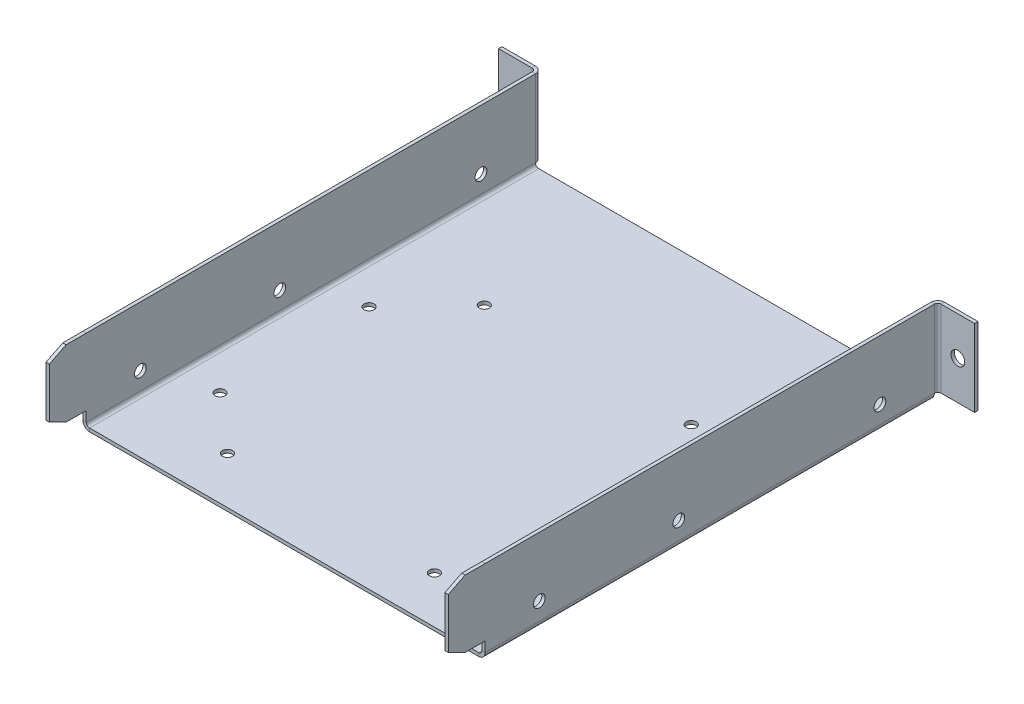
ISO-10303-21;
HEADER;
FILE_DESCRIPTION(('STEP AP214'),'2;1');
FILE_NAME('part.step','',(''),(''),'','','');
FILE_SCHEMA(('AUTOMOTIVE_DESIGN { 1 0 10303 214 1 1 1 1 }'));
ENDSEC;
DATA;
#1=APPLICATION_CONTEXT('core data for automotive mechanical design processes');
#2=APPLICATION_PROTOCOL_DEFINITION('international standard','automotive_design',2000,#1);
#3=PRODUCT_CONTEXT('',#1,'mechanical');
#4=PRODUCT('Part','Part','',(#3));
#5=PRODUCT_RELATED_PRODUCT_CATEGORY('part','',(#4));
#6=PRODUCT_DEFINITION_FORMATION('','',#4);
#7=PRODUCT_DEFINITION_CONTEXT('part definition',#1,'design');
#8=PRODUCT_DEFINITION('design','',#6,#7);
#9=PRODUCT_DEFINITION_SHAPE('','',#8);
#10=(LENGTH_UNIT() NAMED_UNIT(*) SI_UNIT(.MILLI.,.METRE.));
#11=(NAMED_UNIT(*) PLANE_ANGLE_UNIT() SI_UNIT($,.RADIAN.));
#12=(NAMED_UNIT(*) SI_UNIT($,.STERADIAN.) SOLID_ANGLE_UNIT());
#13=UNCERTAINTY_MEASURE_WITH_UNIT(LENGTH_MEASURE(1.E-05),#10,'distance_accuracy_value','');
#14=(GEOMETRIC_REPRESENTATION_CONTEXT(3) GLOBAL_UNCERTAINTY_ASSIGNED_CONTEXT((#13)) GLOBAL_UNIT_ASSIGNED_CONTEXT((#10,
#11,#12)) REPRESENTATION_CONTEXT('',''));
#15=CARTESIAN_POINT('',(0.,0.,0.));
#16=DIRECTION('',(0.,0.,1.));
#17=DIRECTION('',(1.,0.,0.));
#18=AXIS2_PLACEMENT_3D('',#15,#16,#17);
#19=CARTESIAN_POINT('',(-107.95,25.4,-150.));
#20=DIRECTION('',(0.,-1.,0.));
#21=DIRECTION('',(0.,0.,1.));
#22=AXIS2_PLACEMENT_3D('',#19,#20,#21);
#23=PLANE('',#22);
#24=DIRECTION('',(0.,0.,1.));
#25=VECTOR('',#24,1.);
#26=CARTESIAN_POINT('',(-107.95,25.4,-150.));
#27=LINE('',#26,#25);
#28=CARTESIAN_POINT('',(-107.95,25.4,-16.));
#29=VERTEX_POINT('',#28);
#30=CARTESIAN_POINT('',(-107.95,25.4,-9.99999999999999));
#31=VERTEX_POINT('',#30);
#32=EDGE_CURVE('E431',#29,#31,#27,.T.);
#33=ORIENTED_EDGE('',*,*,#32,.T.);
#34=DIRECTION('',(-1.,0.,0.));
#35=VECTOR('',#34,1.);
#36=CARTESIAN_POINT('',(-107.95,25.4,-9.99999999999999));
#37=LINE('',#36,#35);
#38=CARTESIAN_POINT('',(-106.95,25.4,-9.99999999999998));
#39=VERTEX_POINT('',#38);
#40=EDGE_CURVE('E294',#31,#39,#37,.F.);
#41=ORIENTED_EDGE('',*,*,#40,.T.);
#42=DIRECTION('',(0.,0.,1.));
#43=VECTOR('',#42,1.);
#44=CARTESIAN_POINT('',(-106.95,25.4,-150.));
#45=LINE('',#44,#43);
#46=CARTESIAN_POINT('',(-106.95,25.4,-16.));
#47=VERTEX_POINT('',#46);
#48=EDGE_CURVE('E475',#47,#39,#45,.T.);
#49=ORIENTED_EDGE('',*,*,#48,.F.);
#50=DIRECTION('',(1.,0.,0.));
#51=VECTOR('',#50,1.);
#52=CARTESIAN_POINT('',(-107.95,25.4,-16.));
#53=LINE('',#52,#51);
#54=EDGE_CURVE('E525',#47,#29,#53,.F.);
#55=ORIENTED_EDGE('',*,*,#54,.T.);
#56=EDGE_LOOP('',(#33,#41,#49,#55));
#57=FACE_BOUND('',#56,.T.);
#58=ADVANCED_FACE('F88',(#57),#23,.F.);
#59=CARTESIAN_POINT('',(-107.95,0.399999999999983,-150.));
#60=DIRECTION('',(-1.,0.,0.));
#61=DIRECTION('',(0.,0.,1.));
#62=AXIS2_PLACEMENT_3D('',#59,#60,#61);
#63=PLANE('',#62);
#64=CARTESIAN_POINT('',(-107.95,7.59999999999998,-32.15));
#65=DIRECTION('',(-1.,0.,0.));
#66=DIRECTION('',(0.,0.,1.));
#67=AXIS2_PLACEMENT_3D('',#64,#65,#66);
#68=CIRCLE('',#67,1.75);
#69=CARTESIAN_POINT('',(-107.95,7.59999999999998,-30.4));
#70=VERTEX_POINT('',#69);
#71=EDGE_CURVE('E428',#70,#70,#68,.T.);
#72=ORIENTED_EDGE('',*,*,#71,.F.);
#73=EDGE_LOOP('',(#72));
#74=FACE_BOUND('',#73,.T.);
#75=CARTESIAN_POINT('',(-107.95,7.59999999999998,-73.75));
#76=DIRECTION('',(-1.,0.,0.));
#77=DIRECTION('',(0.,0.,1.));
#78=AXIS2_PLACEMENT_3D('',#75,#76,#77);
#79=CIRCLE('',#78,1.75);
#80=CARTESIAN_POINT('',(-107.95,7.59999999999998,-72.));
#81=VERTEX_POINT('',#80);
#82=EDGE_CURVE('E425',#81,#81,#79,.T.);
#83=ORIENTED_EDGE('',*,*,#82,.F.);
#84=EDGE_LOOP('',(#83));
#85=FACE_BOUND('',#84,.T.);
#86=CARTESIAN_POINT('',(-107.95,7.59999999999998,-133.75));
#87=DIRECTION('',(-1.,0.,0.));
#88=DIRECTION('',(0.,0.,1.));
#89=AXIS2_PLACEMENT_3D('',#86,#87,#88);
#90=CIRCLE('',#89,1.75000000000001);
#91=CARTESIAN_POINT('',(-107.95,7.59999999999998,-132.));
#92=VERTEX_POINT('',#91);
#93=EDGE_CURVE('E422',#92,#92,#90,.T.);
#94=ORIENTED_EDGE('',*,*,#93,.F.);
#95=EDGE_LOOP('',(#94));
#96=FACE_BOUND('',#95,.T.);
#97=DIRECTION('',(0.,0.,-1.));
#98=VECTOR('',#97,1.);
#99=CARTESIAN_POINT('',(-107.95,5.39999999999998,-150.));
#100=LINE('',#99,#98);
#101=CARTESIAN_POINT('',(-107.95,5.39999999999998,-10.0000000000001));
#102=VERTEX_POINT('',#101);
#103=CARTESIAN_POINT('',(-107.95,5.39999999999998,-16.));
#104=VERTEX_POINT('',#103);
#105=EDGE_CURVE('E309',#102,#104,#100,.T.);
#106=ORIENTED_EDGE('',*,*,#105,.F.);
#107=DIRECTION('',(0.,-0.447213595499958,-0.894427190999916));
#108=VECTOR('',#107,1.);
#109=CARTESIAN_POINT('',(-107.95,-51.6,-124.));
#110=LINE('',#109,#108);
#111=CARTESIAN_POINT('',(-107.95,7.89999999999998,-5.));
#112=VERTEX_POINT('',#111);
#113=EDGE_CURVE('E105',#112,#102,#110,.T.);
#114=ORIENTED_EDGE('',*,*,#113,.F.);
#115=DIRECTION('',(0.,-1.,0.));
#116=VECTOR('',#115,1.);
#117=CARTESIAN_POINT('',(-107.95,0.399999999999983,-5.));
#118=LINE('',#117,#116);
#119=CARTESIAN_POINT('',(-107.95,22.9,-5.));
#120=VERTEX_POINT('',#119);
#121=EDGE_CURVE('E875',#120,#112,#118,.T.);
#122=ORIENTED_EDGE('',*,*,#121,.F.);
#123=DIRECTION('',(0.,-0.447213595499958,0.894427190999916));
#124=VECTOR('',#123,1.);
#125=CARTESIAN_POINT('',(-107.95,76.3999999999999,-112.));
#126=LINE('',#125,#124);
#127=EDGE_CURVE('E877',#31,#120,#126,.T.);
#128=ORIENTED_EDGE('',*,*,#127,.F.);
#129=ORIENTED_EDGE('',*,*,#32,.F.);
#130=CARTESIAN_POINT('',(-107.95,25.4,-150.));
#131=VERTEX_POINT('',#130);
#132=EDGE_CURVE('E432',#131,#29,#27,.T.);
#133=ORIENTED_EDGE('',*,*,#132,.F.);
#134=DIRECTION('',(0.,-1.,0.));
#135=VECTOR('',#134,1.);
#136=CARTESIAN_POINT('',(-107.95,0.399999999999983,-150.));
#137=LINE('',#136,#135);
#138=CARTESIAN_POINT('',(-107.95,2.39999999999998,-150.));
#139=VERTEX_POINT('',#138);
#140=EDGE_CURVE('E435',#131,#139,#137,.T.);
#141=ORIENTED_EDGE('',*,*,#140,.T.);
#142=DIRECTION('',(0.,0.,1.));
#143=VECTOR('',#142,1.);
#144=CARTESIAN_POINT('',(-107.95,2.39999999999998,-150.));
#145=LINE('',#144,#143);
#146=CARTESIAN_POINT('',(-107.95,2.39999999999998,-16.));
#147=VERTEX_POINT('',#146);
#148=EDGE_CURVE('E443',#139,#147,#145,.T.);
#149=ORIENTED_EDGE('',*,*,#148,.T.);
#150=DIRECTION('',(0.,-1.,0.));
#151=VECTOR('',#150,1.);
#152=CARTESIAN_POINT('',(-107.95,0.39999999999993,-16.));
#153=LINE('',#152,#151);
#154=EDGE_CURVE('E315',#104,#147,#153,.T.);
#155=ORIENTED_EDGE('',*,*,#154,.F.);
#156=EDGE_LOOP('',(#106,#114,#122,#128,#129,#133,#141,#149,#155));
#157=FACE_BOUND('',#156,.T.);
#158=ADVANCED_FACE('F632',(#74,#85,#96,#157),#63,.T.);
#159=CARTESIAN_POINT('',(-106.95,0.399999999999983,-150.));
#160=DIRECTION('',(-1.,0.,0.));
#161=DIRECTION('',(0.,0.,1.));
#162=AXIS2_PLACEMENT_3D('',#159,#160,#161);
#163=PLANE('',#162);
#164=CARTESIAN_POINT('',(-106.95,7.59999999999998,-32.15));
#165=DIRECTION('',(-1.,0.,0.));
#166=DIRECTION('',(0.,0.,1.));
#167=AXIS2_PLACEMENT_3D('',#164,#165,#166);
#168=CIRCLE('',#167,1.75);
#169=CARTESIAN_POINT('',(-106.95,7.59999999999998,-30.4));
#170=VERTEX_POINT('',#169);
#171=EDGE_CURVE('E472',#170,#170,#168,.T.);
#172=ORIENTED_EDGE('',*,*,#171,.T.);
#173=EDGE_LOOP('',(#172));
#174=FACE_BOUND('',#173,.T.);
#175=CARTESIAN_POINT('',(-106.95,7.59999999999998,-73.75));
#176=DIRECTION('',(-1.,0.,0.));
#177=DIRECTION('',(0.,0.,1.));
#178=AXIS2_PLACEMENT_3D('',#175,#176,#177);
#179=CIRCLE('',#178,1.75);
#180=CARTESIAN_POINT('',(-106.95,7.59999999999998,-72.));
#181=VERTEX_POINT('',#180);
#182=EDGE_CURVE('E468',#181,#181,#179,.T.);
#183=ORIENTED_EDGE('',*,*,#182,.T.);
#184=EDGE_LOOP('',(#183));
#185=FACE_BOUND('',#184,.T.);
#186=CARTESIAN_POINT('',(-106.95,7.59999999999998,-133.75));
#187=DIRECTION('',(-1.,0.,0.));
#188=DIRECTION('',(0.,0.,1.));
#189=AXIS2_PLACEMENT_3D('',#186,#187,#188);
#190=CIRCLE('',#189,1.75000000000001);
#191=CARTESIAN_POINT('',(-106.95,7.59999999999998,-132.));
#192=VERTEX_POINT('',#191);
#193=EDGE_CURVE('E465',#192,#192,#190,.T.);
#194=ORIENTED_EDGE('',*,*,#193,.T.);
#195=EDGE_LOOP('',(#194));
#196=FACE_BOUND('',#195,.T.);
#197=DIRECTION('',(0.,-0.447213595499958,-0.894427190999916));
#198=VECTOR('',#197,1.);
#199=CARTESIAN_POINT('',(-106.95,-51.6,-124.));
#200=LINE('',#199,#198);
#201=CARTESIAN_POINT('',(-106.95,7.89999999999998,-5.));
#202=VERTEX_POINT('',#201);
#203=CARTESIAN_POINT('',(-106.95,5.39999999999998,-10.));
#204=VERTEX_POINT('',#203);
#205=EDGE_CURVE('E288',#202,#204,#200,.T.);
#206=ORIENTED_EDGE('',*,*,#205,.T.);
#207=DIRECTION('',(0.,0.,-1.));
#208=VECTOR('',#207,1.);
#209=CARTESIAN_POINT('',(-106.95,5.39999999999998,-150.));
#210=LINE('',#209,#208);
#211=CARTESIAN_POINT('',(-106.95,5.39999999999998,-16.));
#212=VERTEX_POINT('',#211);
#213=EDGE_CURVE('E300',#204,#212,#210,.T.);
#214=ORIENTED_EDGE('',*,*,#213,.T.);
#215=DIRECTION('',(0.,-1.,0.));
#216=VECTOR('',#215,1.);
#217=CARTESIAN_POINT('',(-106.95,0.39999999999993,-16.));
#218=LINE('',#217,#216);
#219=CARTESIAN_POINT('',(-106.95,2.39999999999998,-16.));
#220=VERTEX_POINT('',#219);
#221=EDGE_CURVE('E606',#212,#220,#218,.T.);
#222=ORIENTED_EDGE('',*,*,#221,.T.);
#223=DIRECTION('',(0.,0.,1.));
#224=VECTOR('',#223,1.);
#225=CARTESIAN_POINT('',(-106.95,2.39999999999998,-150.));
#226=LINE('',#225,#224);
#227=CARTESIAN_POINT('',(-106.95,2.39999999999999,-150.));
#228=VERTEX_POINT('',#227);
#229=EDGE_CURVE('E455',#228,#220,#226,.T.);
#230=ORIENTED_EDGE('',*,*,#229,.F.);
#231=DIRECTION('',(0.,1.,0.));
#232=VECTOR('',#231,1.);
#233=CARTESIAN_POINT('',(-106.95,0.399999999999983,-150.));
#234=LINE('',#233,#232);
#235=CARTESIAN_POINT('',(-106.95,25.4,-150.));
#236=VERTEX_POINT('',#235);
#237=EDGE_CURVE('E463',#236,#228,#234,.F.);
#238=ORIENTED_EDGE('',*,*,#237,.F.);
#239=EDGE_CURVE('E478',#236,#47,#45,.T.);
#240=ORIENTED_EDGE('',*,*,#239,.T.);
#241=ORIENTED_EDGE('',*,*,#48,.T.);
#242=DIRECTION('',(0.,-0.447213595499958,0.894427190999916));
#243=VECTOR('',#242,1.);
#244=CARTESIAN_POINT('',(-106.95,76.3999999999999,-112.));
#245=LINE('',#244,#243);
#246=CARTESIAN_POINT('',(-106.95,22.9,-5.));
#247=VERTEX_POINT('',#246);
#248=EDGE_CURVE('E874',#39,#247,#245,.T.);
#249=ORIENTED_EDGE('',*,*,#248,.T.);
#250=DIRECTION('',(0.,1.,0.));
#251=VECTOR('',#250,1.);
#252=CARTESIAN_POINT('',(-106.95,0.399999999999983,-5.));
#253=LINE('',#252,#251);
#254=EDGE_CURVE('E303',#247,#202,#253,.F.);
#255=ORIENTED_EDGE('',*,*,#254,.T.);
#256=EDGE_LOOP('',(#206,#214,#222,#230,#238,#240,#241,#249,#255));
#257=FACE_BOUND('',#256,.T.);
#258=ADVANCED_FACE('F298',(#174,#185,#196,#257),#163,.F.);
#259=CARTESIAN_POINT('',(-157.95,5.39999999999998,0.));
#260=DIRECTION('',(0.,1.,0.));
#261=DIRECTION('',(-1.,0.,0.));
#262=AXIS2_PLACEMENT_3D('',#259,#260,#261);
#263=PLANE('',#262);
#264=DIRECTION('',(-1.,0.,0.));
#265=VECTOR('',#264,1.);
#266=CARTESIAN_POINT('',(-107.95,5.39999999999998,-10.));
#267=LINE('',#266,#265);
#268=EDGE_CURVE('E285',#102,#204,#267,.F.);
#269=ORIENTED_EDGE('',*,*,#268,.F.);
#270=ORIENTED_EDGE('',*,*,#105,.T.);
#271=DIRECTION('',(1.,0.,0.));
#272=VECTOR('',#271,1.);
#273=CARTESIAN_POINT('',(-157.95,5.39999999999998,-16.));
#274=LINE('',#273,#272);
#275=EDGE_CURVE('E308',#104,#212,#274,.T.);
#276=ORIENTED_EDGE('',*,*,#275,.T.);
#277=ORIENTED_EDGE('',*,*,#213,.F.);
#278=EDGE_LOOP('',(#269,#270,#276,#277));
#279=FACE_BOUND('',#278,.T.);
#280=ADVANCED_FACE('F306',(#279),#263,.F.);
#281=CARTESIAN_POINT('',(12.05,25.4,-150.));
#282=DIRECTION('',(0.,1.,0.));
#283=DIRECTION('',(0.,0.,1.));
#284=AXIS2_PLACEMENT_3D('',#281,#282,#283);
#285=PLANE('',#284);
#286=DIRECTION('',(0.,0.,1.));
#287=VECTOR('',#286,1.);
#288=CARTESIAN_POINT('',(11.05,25.4,-150.));
#289=LINE('',#288,#287);
#290=CARTESIAN_POINT('',(11.05,25.4,-16.));
#291=VERTEX_POINT('',#290);
#292=CARTESIAN_POINT('',(11.05,25.4,-9.99999999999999));
#293=VERTEX_POINT('',#292);
#294=EDGE_CURVE('E483',#291,#293,#289,.T.);
#295=ORIENTED_EDGE('',*,*,#294,.T.);
#296=DIRECTION('',(-1.,0.,0.));
#297=VECTOR('',#296,1.);
#298=CARTESIAN_POINT('',(11.05,25.4,-9.99999999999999));
#299=LINE('',#298,#297);
#300=CARTESIAN_POINT('',(12.05,25.4,-9.99999999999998));
#301=VERTEX_POINT('',#300);
#302=EDGE_CURVE('E847',#293,#301,#299,.F.);
#303=ORIENTED_EDGE('',*,*,#302,.T.);
#304=DIRECTION('',(0.,0.,1.));
#305=VECTOR('',#304,1.);
#306=CARTESIAN_POINT('',(12.05,25.4,-150.));
#307=LINE('',#306,#305);
#308=CARTESIAN_POINT('',(12.05,25.4,-16.));
#309=VERTEX_POINT('',#308);
#310=EDGE_CURVE('E418',#309,#301,#307,.T.);
#311=ORIENTED_EDGE('',*,*,#310,.F.);
#312=DIRECTION('',(-1.,0.,0.));
#313=VECTOR('',#312,1.);
#314=CARTESIAN_POINT('',(12.05,25.4,-16.));
#315=LINE('',#314,#313);
#316=EDGE_CURVE('E527',#309,#291,#315,.T.);
#317=ORIENTED_EDGE('',*,*,#316,.T.);
#318=EDGE_LOOP('',(#295,#303,#311,#317));
#319=FACE_BOUND('',#318,.T.);
#320=ADVANCED_FACE('F704',(#319),#285,.T.);
#321=CARTESIAN_POINT('',(12.05,25.4,-150.));
#322=DIRECTION('',(1.,0.,0.));
#323=DIRECTION('',(0.,1.,0.));
#324=AXIS2_PLACEMENT_3D('',#321,#322,#323);
#325=PLANE('',#324);
#326=CARTESIAN_POINT('',(12.05,7.59999999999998,-32.15));
#327=DIRECTION('',(1.,0.,0.));
#328=DIRECTION('',(0.,1.,0.));
#329=AXIS2_PLACEMENT_3D('',#326,#327,#328);
#330=CIRCLE('',#329,1.75);
#331=CARTESIAN_POINT('',(12.05,9.34999999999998,-32.15));
#332=VERTEX_POINT('',#331);
#333=EDGE_CURVE('E413',#332,#332,#330,.T.);
#334=ORIENTED_EDGE('',*,*,#333,.F.);
#335=EDGE_LOOP('',(#334));
#336=FACE_BOUND('',#335,.T.);
#337=CARTESIAN_POINT('',(12.05,7.59999999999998,-73.75));
#338=DIRECTION('',(1.,0.,0.));
#339=DIRECTION('',(0.,1.,0.));
#340=AXIS2_PLACEMENT_3D('',#337,#338,#339);
#341=CIRCLE('',#340,1.75);
#342=CARTESIAN_POINT('',(12.05,9.34999999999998,-73.75));
#343=VERTEX_POINT('',#342);
#344=EDGE_CURVE('E410',#343,#343,#341,.T.);
#345=ORIENTED_EDGE('',*,*,#344,.F.);
#346=EDGE_LOOP('',(#345));
#347=FACE_BOUND('',#346,.T.);
#348=CARTESIAN_POINT('',(12.05,7.59999999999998,-133.75));
#349=DIRECTION('',(1.,0.,0.));
#350=DIRECTION('',(0.,1.,0.));
#351=AXIS2_PLACEMENT_3D('',#348,#349,#350);
#352=CIRCLE('',#351,1.75000000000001);
#353=CARTESIAN_POINT('',(12.05,9.34999999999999,-133.75));
#354=VERTEX_POINT('',#353);
#355=EDGE_CURVE('E406',#354,#354,#352,.T.);
#356=ORIENTED_EDGE('',*,*,#355,.F.);
#357=EDGE_LOOP('',(#356));
#358=FACE_BOUND('',#357,.T.);
#359=DIRECTION('',(0.,1.,0.));
#360=VECTOR('',#359,1.);
#361=CARTESIAN_POINT('',(12.05,25.4,-5.));
#362=LINE('',#361,#360);
#363=CARTESIAN_POINT('',(12.05,7.9,-5.));
#364=VERTEX_POINT('',#363);
#365=CARTESIAN_POINT('',(12.05,22.9,-5.));
#366=VERTEX_POINT('',#365);
#367=EDGE_CURVE('E841',#364,#366,#362,.T.);
#368=ORIENTED_EDGE('',*,*,#367,.F.);
#369=DIRECTION('',(0.,0.447213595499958,0.894427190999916));
#370=VECTOR('',#369,1.);
#371=CARTESIAN_POINT('',(12.05,-46.6,-114.));
#372=LINE('',#371,#370);
#373=CARTESIAN_POINT('',(12.05,5.4,-10.));
#374=VERTEX_POINT('',#373);
#375=EDGE_CURVE('E856',#374,#364,#372,.T.);
#376=ORIENTED_EDGE('',*,*,#375,.F.);
#377=DIRECTION('',(0.,0.,1.));
#378=VECTOR('',#377,1.);
#379=CARTESIAN_POINT('',(12.05,5.4,0.));
#380=LINE('',#379,#378);
#381=CARTESIAN_POINT('',(12.05,5.4,-16.));
#382=VERTEX_POINT('',#381);
#383=EDGE_CURVE('E598',#382,#374,#380,.T.);
#384=ORIENTED_EDGE('',*,*,#383,.F.);
#385=DIRECTION('',(0.,1.,0.));
#386=VECTOR('',#385,1.);
#387=CARTESIAN_POINT('',(12.05,5.4,-16.));
#388=LINE('',#387,#386);
#389=CARTESIAN_POINT('',(12.05,2.4,-16.));
#390=VERTEX_POINT('',#389);
#391=EDGE_CURVE('E537',#390,#382,#388,.T.);
#392=ORIENTED_EDGE('',*,*,#391,.F.);
#393=DIRECTION('',(0.,0.,1.));
#394=VECTOR('',#393,1.);
#395=CARTESIAN_POINT('',(12.05,2.4,-150.));
#396=LINE('',#395,#394);
#397=CARTESIAN_POINT('',(12.05,2.4,-150.));
#398=VERTEX_POINT('',#397);
#399=EDGE_CURVE('E441',#390,#398,#396,.F.);
#400=ORIENTED_EDGE('',*,*,#399,.T.);
#401=DIRECTION('',(0.,1.,0.));
#402=VECTOR('',#401,1.);
#403=CARTESIAN_POINT('',(12.05,25.4,-150.));
#404=LINE('',#403,#402);
#405=CARTESIAN_POINT('',(12.05,25.4,-150.));
#406=VERTEX_POINT('',#405);
#407=EDGE_CURVE('E416',#398,#406,#404,.T.);
#408=ORIENTED_EDGE('',*,*,#407,.T.);
#409=EDGE_CURVE('E419',#406,#309,#307,.T.);
#410=ORIENTED_EDGE('',*,*,#409,.T.);
#411=ORIENTED_EDGE('',*,*,#310,.T.);
#412=DIRECTION('',(0.,0.447213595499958,-0.894427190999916));
#413=VECTOR('',#412,1.);
#414=CARTESIAN_POINT('',(12.05,81.3999999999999,-122.));
#415=LINE('',#414,#413);
#416=EDGE_CURVE('E839',#366,#301,#415,.T.);
#417=ORIENTED_EDGE('',*,*,#416,.F.);
#418=EDGE_LOOP('',(#368,#376,#384,#392,#400,#408,#410,#411,#417));
#419=FACE_BOUND('',#418,.T.);
#420=ADVANCED_FACE('F762',(#336,#347,#358,#419),#325,.T.);
#421=CARTESIAN_POINT('',(11.05,25.4,-150.));
#422=DIRECTION('',(1.,0.,0.));
#423=DIRECTION('',(0.,1.,0.));
#424=AXIS2_PLACEMENT_3D('',#421,#422,#423);
#425=PLANE('',#424);
#426=CARTESIAN_POINT('',(11.05,7.59999999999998,-32.15));
#427=DIRECTION('',(1.,0.,0.));
#428=DIRECTION('',(0.,1.,0.));
#429=AXIS2_PLACEMENT_3D('',#426,#427,#428);
#430=CIRCLE('',#429,1.75);
#431=CARTESIAN_POINT('',(11.05,9.34999999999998,-32.15));
#432=VERTEX_POINT('',#431);
#433=EDGE_CURVE('E487',#432,#432,#430,.T.);
#434=ORIENTED_EDGE('',*,*,#433,.T.);
#435=EDGE_LOOP('',(#434));
#436=FACE_BOUND('',#435,.T.);
#437=CARTESIAN_POINT('',(11.05,7.59999999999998,-73.75));
#438=DIRECTION('',(1.,0.,0.));
#439=DIRECTION('',(0.,1.,0.));
#440=AXIS2_PLACEMENT_3D('',#437,#438,#439);
#441=CIRCLE('',#440,1.75);
#442=CARTESIAN_POINT('',(11.05,9.34999999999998,-73.75));
#443=VERTEX_POINT('',#442);
#444=EDGE_CURVE('E499',#443,#443,#441,.T.);
#445=ORIENTED_EDGE('',*,*,#444,.T.);
#446=EDGE_LOOP('',(#445));
#447=FACE_BOUND('',#446,.T.);
#448=CARTESIAN_POINT('',(11.05,7.59999999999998,-133.75));
#449=DIRECTION('',(1.,0.,0.));
#450=DIRECTION('',(0.,1.,0.));
#451=AXIS2_PLACEMENT_3D('',#448,#449,#450);
#452=CIRCLE('',#451,1.75000000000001);
#453=CARTESIAN_POINT('',(11.05,9.34999999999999,-133.75));
#454=VERTEX_POINT('',#453);
#455=EDGE_CURVE('E494',#454,#454,#452,.T.);
#456=ORIENTED_EDGE('',*,*,#455,.T.);
#457=EDGE_LOOP('',(#456));
#458=FACE_BOUND('',#457,.T.);
#459=DIRECTION('',(0.,0.447213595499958,0.894427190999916));
#460=VECTOR('',#459,1.);
#461=CARTESIAN_POINT('',(11.05,-46.6,-114.));
#462=LINE('',#461,#460);
#463=CARTESIAN_POINT('',(11.05,5.4,-10.));
#464=VERTEX_POINT('',#463);
#465=CARTESIAN_POINT('',(11.05,7.9,-5.));
#466=VERTEX_POINT('',#465);
#467=EDGE_CURVE('E113',#464,#466,#462,.T.);
#468=ORIENTED_EDGE('',*,*,#467,.T.);
#469=DIRECTION('',(0.,1.,0.));
#470=VECTOR('',#469,1.);
#471=CARTESIAN_POINT('',(11.05,25.4,-5.));
#472=LINE('',#471,#470);
#473=CARTESIAN_POINT('',(11.05,22.9,-5.));
#474=VERTEX_POINT('',#473);
#475=EDGE_CURVE('E838',#466,#474,#472,.T.);
#476=ORIENTED_EDGE('',*,*,#475,.T.);
#477=DIRECTION('',(0.,0.447213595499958,-0.894427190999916));
#478=VECTOR('',#477,1.);
#479=CARTESIAN_POINT('',(11.05,81.3999999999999,-122.));
#480=LINE('',#479,#478);
#481=EDGE_CURVE('E843',#474,#293,#480,.T.);
#482=ORIENTED_EDGE('',*,*,#481,.T.);
#483=ORIENTED_EDGE('',*,*,#294,.F.);
#484=CARTESIAN_POINT('',(11.05,25.4,-150.));
#485=VERTEX_POINT('',#484);
#486=EDGE_CURVE('E469',#485,#291,#289,.T.);
#487=ORIENTED_EDGE('',*,*,#486,.F.);
#488=DIRECTION('',(0.,1.,0.));
#489=VECTOR('',#488,1.);
#490=CARTESIAN_POINT('',(11.05,25.4,-150.));
#491=LINE('',#490,#489);
#492=CARTESIAN_POINT('',(11.05,2.4,-150.));
#493=VERTEX_POINT('',#492);
#494=EDGE_CURVE('E484',#493,#485,#491,.T.);
#495=ORIENTED_EDGE('',*,*,#494,.F.);
#496=DIRECTION('',(0.,0.,1.));
#497=VECTOR('',#496,1.);
#498=CARTESIAN_POINT('',(11.05,2.4,-150.));
#499=LINE('',#498,#497);
#500=CARTESIAN_POINT('',(11.05,2.4,-16.));
#501=VERTEX_POINT('',#500);
#502=EDGE_CURVE('E458',#501,#493,#499,.F.);
#503=ORIENTED_EDGE('',*,*,#502,.F.);
#504=DIRECTION('',(0.,1.,0.));
#505=VECTOR('',#504,1.);
#506=CARTESIAN_POINT('',(11.05,25.3999999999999,-16.));
#507=LINE('',#506,#505);
#508=CARTESIAN_POINT('',(11.05,5.4,-16.));
#509=VERTEX_POINT('',#508);
#510=EDGE_CURVE('E611',#501,#509,#507,.T.);
#511=ORIENTED_EDGE('',*,*,#510,.T.);
#512=DIRECTION('',(0.,0.,1.));
#513=VECTOR('',#512,1.);
#514=CARTESIAN_POINT('',(11.05,5.4,-150.));
#515=LINE('',#514,#513);
#516=EDGE_CURVE('E522',#509,#464,#515,.T.);
#517=ORIENTED_EDGE('',*,*,#516,.T.);
#518=EDGE_LOOP('',(#468,#476,#482,#483,#487,#495,#503,#511,#517));
#519=FACE_BOUND('',#518,.T.);
#520=ADVANCED_FACE('F764',(#436,#447,#458,#519),#425,.F.);
#521=DIRECTION('',(-1.,0.,0.));
#522=VECTOR('',#521,1.);
#523=CARTESIAN_POINT('',(11.05,5.4,-10.));
#524=LINE('',#523,#522);
#525=EDGE_CURVE('E850',#464,#374,#524,.F.);
#526=ORIENTED_EDGE('',*,*,#525,.F.);
#527=ORIENTED_EDGE('',*,*,#516,.F.);
#528=EDGE_CURVE('E601',#509,#382,#274,.T.);
#529=ORIENTED_EDGE('',*,*,#528,.T.);
#530=ORIENTED_EDGE('',*,*,#383,.T.);
#531=EDGE_LOOP('',(#526,#527,#529,#530));
#532=FACE_BOUND('',#531,.T.);
#533=ADVANCED_FACE('F778',(#532),#263,.F.);
#534=CARTESIAN_POINT('',(-157.95,5.39999999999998,-16.));
#535=DIRECTION('',(0.,0.,-1.));
#536=DIRECTION('',(0.,1.,0.));
#537=AXIS2_PLACEMENT_3D('',#534,#535,#536);
#538=PLANE('',#537);
#539=ORIENTED_EDGE('',*,*,#154,.T.);
#540=DIRECTION('',(1.,0.,0.));
#541=VECTOR('',#540,1.);
#542=CARTESIAN_POINT('',(-107.95,2.39999999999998,-16.));
#543=LINE('',#542,#541);
#544=EDGE_CURVE('E15',#147,#220,#543,.T.);
#545=ORIENTED_EDGE('',*,*,#544,.T.);
#546=ORIENTED_EDGE('',*,*,#221,.F.);
#547=ORIENTED_EDGE('',*,*,#275,.F.);
#548=EDGE_LOOP('',(#539,#545,#546,#547));
#549=FACE_BOUND('',#548,.T.);
#550=ADVANCED_FACE('F623',(#549),#538,.F.);
#551=DIRECTION('',(1.,0.,0.));
#552=VECTOR('',#551,1.);
#553=CARTESIAN_POINT('',(12.05,1.4,-16.));
#554=LINE('',#553,#552);
#555=CARTESIAN_POINT('',(-105.95,1.39999999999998,-16.));
#556=VERTEX_POINT('',#555);
#557=CARTESIAN_POINT('',(10.05,1.4,-16.));
#558=VERTEX_POINT('',#557);
#559=EDGE_CURVE('E603',#556,#558,#554,.T.);
#560=ORIENTED_EDGE('',*,*,#559,.F.);
#561=DIRECTION('',(0.,-1.,0.));
#562=VECTOR('',#561,1.);
#563=CARTESIAN_POINT('',(-105.95,1.39999999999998,-16.));
#564=LINE('',#563,#562);
#565=CARTESIAN_POINT('',(-105.95,0.399999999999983,-16.));
#566=VERTEX_POINT('',#565);
#567=EDGE_CURVE('E97',#556,#566,#564,.T.);
#568=ORIENTED_EDGE('',*,*,#567,.T.);
#569=DIRECTION('',(1.,0.,0.));
#570=VECTOR('',#569,1.);
#571=CARTESIAN_POINT('',(12.05,0.399999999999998,-16.));
#572=LINE('',#571,#570);
#573=CARTESIAN_POINT('',(10.05,0.399999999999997,-16.));
#574=VERTEX_POINT('',#573);
#575=EDGE_CURVE('E617',#566,#574,#572,.T.);
#576=ORIENTED_EDGE('',*,*,#575,.T.);
#577=DIRECTION('',(0.,1.,0.));
#578=VECTOR('',#577,1.);
#579=CARTESIAN_POINT('',(10.05,0.399999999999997,-16.));
#580=LINE('',#579,#578);
#581=EDGE_CURVE('E529',#574,#558,#580,.T.);
#582=ORIENTED_EDGE('',*,*,#581,.T.);
#583=EDGE_LOOP('',(#560,#568,#576,#582));
#584=FACE_BOUND('',#583,.T.);
#585=ADVANCED_FACE('F1179',(#584),#538,.F.);
#586=ORIENTED_EDGE('',*,*,#510,.F.);
#587=DIRECTION('',(1.,0.,0.));
#588=VECTOR('',#587,1.);
#589=CARTESIAN_POINT('',(11.05,2.4,-16.));
#590=LINE('',#589,#588);
#591=EDGE_CURVE('E531',#501,#390,#590,.T.);
#592=ORIENTED_EDGE('',*,*,#591,.T.);
#593=ORIENTED_EDGE('',*,*,#391,.T.);
#594=ORIENTED_EDGE('',*,*,#528,.F.);
#595=EDGE_LOOP('',(#586,#592,#593,#594));
#596=FACE_BOUND('',#595,.T.);
#597=ADVANCED_FACE('F1171',(#596),#538,.F.);
#598=ORIENTED_EDGE('',*,*,#544,.F.);
#599=CARTESIAN_POINT('',(-105.95,2.39999999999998,-16.));
#600=DIRECTION('',(0.,0.,-1.));
#601=DIRECTION('',(0.,1.,0.));
#602=AXIS2_PLACEMENT_3D('',#599,#600,#601);
#603=CIRCLE('',#602,2.);
#604=EDGE_CURVE('E614',#147,#566,#603,.F.);
#605=ORIENTED_EDGE('',*,*,#604,.T.);
#606=ORIENTED_EDGE('',*,*,#567,.F.);
#607=CARTESIAN_POINT('',(-105.95,2.39999999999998,-16.));
#608=DIRECTION('',(0.,0.,-1.));
#609=DIRECTION('',(0.,1.,0.));
#610=AXIS2_PLACEMENT_3D('',#607,#608,#609);
#611=CIRCLE('',#610,1.);
#612=EDGE_CURVE('E517',#220,#556,#611,.F.);
#613=ORIENTED_EDGE('',*,*,#612,.F.);
#614=EDGE_LOOP('',(#598,#605,#606,#613));
#615=FACE_BOUND('',#614,.T.);
#616=ADVANCED_FACE('F949',(#615),#538,.F.);
#617=CARTESIAN_POINT('',(12.05,0.399999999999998,-150.));
#618=DIRECTION('',(0.,0.,-1.));
#619=DIRECTION('',(1.,0.,0.));
#620=AXIS2_PLACEMENT_3D('',#617,#618,#619);
#621=PLANE('',#620);
#622=DIRECTION('',(0.,-1.,0.));
#623=VECTOR('',#622,1.);
#624=CARTESIAN_POINT('',(-105.95,0.399999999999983,-150.));
#625=LINE('',#624,#623);
#626=CARTESIAN_POINT('',(-105.95,1.39999999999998,-150.));
#627=VERTEX_POINT('',#626);
#628=CARTESIAN_POINT('',(-105.95,0.399999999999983,-150.));
#629=VERTEX_POINT('',#628);
#630=EDGE_CURVE('E514',#627,#629,#625,.T.);
#631=ORIENTED_EDGE('',*,*,#630,.F.);
#632=DIRECTION('',(1.,0.,0.));
#633=VECTOR('',#632,1.);
#634=CARTESIAN_POINT('',(12.05,1.4,-150.));
#635=LINE('',#634,#633);
#636=CARTESIAN_POINT('',(10.05,1.4,-150.));
#637=VERTEX_POINT('',#636);
#638=EDGE_CURVE('E491',#627,#637,#635,.T.);
#639=ORIENTED_EDGE('',*,*,#638,.T.);
#640=DIRECTION('',(0.,-1.,0.));
#641=VECTOR('',#640,1.);
#642=CARTESIAN_POINT('',(10.05,0.399999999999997,-150.));
#643=LINE('',#642,#641);
#644=CARTESIAN_POINT('',(10.05,0.399999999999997,-150.));
#645=VERTEX_POINT('',#644);
#646=EDGE_CURVE('E512',#637,#645,#643,.T.);
#647=ORIENTED_EDGE('',*,*,#646,.T.);
#648=DIRECTION('',(1.,0.,0.));
#649=VECTOR('',#648,1.);
#650=CARTESIAN_POINT('',(12.05,0.399999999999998,-150.));
#651=LINE('',#650,#649);
#652=EDGE_CURVE('E403',#629,#645,#651,.T.);
#653=ORIENTED_EDGE('',*,*,#652,.F.);
#654=EDGE_LOOP('',(#631,#639,#647,#653));
#655=FACE_BOUND('',#654,.T.);
#656=ADVANCED_FACE('F821',(#655),#621,.T.);
#657=CARTESIAN_POINT('',(10.05,2.4,-150.));
#658=DIRECTION('',(0.,0.,1.));
#659=DIRECTION('',(1.,0.,0.));
#660=AXIS2_PLACEMENT_3D('',#657,#658,#659);
#661=PLANE('',#660);
#662=ORIENTED_EDGE('',*,*,#646,.F.);
#663=CARTESIAN_POINT('',(10.05,2.4,-150.));
#664=DIRECTION('',(0.,0.,1.));
#665=DIRECTION('',(1.,0.,0.));
#666=AXIS2_PLACEMENT_3D('',#663,#664,#665);
#667=CIRCLE('',#666,1.);
#668=EDGE_CURVE('E488',#637,#493,#667,.T.);
#669=ORIENTED_EDGE('',*,*,#668,.T.);
#670=DIRECTION('',(1.,0.,0.));
#671=VECTOR('',#670,1.);
#672=CARTESIAN_POINT('',(12.05,2.4,-150.));
#673=LINE('',#672,#671);
#674=EDGE_CURVE('E509',#493,#398,#673,.T.);
#675=ORIENTED_EDGE('',*,*,#674,.T.);
#676=CARTESIAN_POINT('',(10.05,2.4,-150.));
#677=DIRECTION('',(0.,0.,-1.));
#678=DIRECTION('',(-1.,0.,0.));
#679=AXIS2_PLACEMENT_3D('',#676,#677,#678);
#680=CIRCLE('',#679,2.);
#681=EDGE_CURVE('E407',#645,#398,#680,.F.);
#682=ORIENTED_EDGE('',*,*,#681,.F.);
#683=EDGE_LOOP('',(#662,#669,#675,#682));
#684=FACE_BOUND('',#683,.T.);
#685=ADVANCED_FACE('F702',(#684),#661,.F.);
#686=ORIENTED_EDGE('',*,*,#316,.F.);
#687=ORIENTED_EDGE('',*,*,#409,.F.);
#688=DIRECTION('',(1.,0.,0.));
#689=VECTOR('',#688,1.);
#690=CARTESIAN_POINT('',(12.05,25.4,-150.));
#691=LINE('',#690,#689);
#692=EDGE_CURVE('E506',#485,#406,#691,.T.);
#693=ORIENTED_EDGE('',*,*,#692,.F.);
#694=ORIENTED_EDGE('',*,*,#486,.T.);
#695=EDGE_LOOP('',(#686,#687,#693,#694));
#696=FACE_BOUND('',#695,.T.);
#697=ADVANCED_FACE('F693',(#696),#285,.T.);
#698=ORIENTED_EDGE('',*,*,#54,.F.);
#699=ORIENTED_EDGE('',*,*,#239,.F.);
#700=DIRECTION('',(-1.,0.,0.));
#701=VECTOR('',#700,1.);
#702=CARTESIAN_POINT('',(-107.95,25.4,-150.));
#703=LINE('',#702,#701);
#704=EDGE_CURVE('E504',#236,#131,#703,.T.);
#705=ORIENTED_EDGE('',*,*,#704,.T.);
#706=ORIENTED_EDGE('',*,*,#132,.T.);
#707=EDGE_LOOP('',(#698,#699,#705,#706));
#708=FACE_BOUND('',#707,.T.);
#709=ADVANCED_FACE('F682',(#708),#23,.F.);
#710=CARTESIAN_POINT('',(12.05,7.59999999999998,-133.75));
#711=DIRECTION('',(1.,0.,0.));
#712=DIRECTION('',(0.,1.,0.));
#713=AXIS2_PLACEMENT_3D('',#710,#711,#712);
#714=CYLINDRICAL_SURFACE('',#713,1.75000000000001);
#715=ORIENTED_EDGE('',*,*,#355,.T.);
#716=EDGE_LOOP('',(#715));
#717=FACE_BOUND('',#716,.T.);
#718=ORIENTED_EDGE('',*,*,#455,.F.);
#719=EDGE_LOOP('',(#718));
#720=FACE_BOUND('',#719,.T.);
#721=ADVANCED_FACE('F692',(#717,#720),#714,.F.);
#722=CARTESIAN_POINT('',(12.05,7.59999999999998,-73.75));
#723=DIRECTION('',(1.,0.,0.));
#724=DIRECTION('',(0.,1.,0.));
#725=AXIS2_PLACEMENT_3D('',#722,#723,#724);
#726=CYLINDRICAL_SURFACE('',#725,1.75);
#727=ORIENTED_EDGE('',*,*,#344,.T.);
#728=EDGE_LOOP('',(#727));
#729=FACE_BOUND('',#728,.T.);
#730=ORIENTED_EDGE('',*,*,#444,.F.);
#731=EDGE_LOOP('',(#730));
#732=FACE_BOUND('',#731,.T.);
#733=ADVANCED_FACE('F699',(#729,#732),#726,.F.);
#734=CARTESIAN_POINT('',(12.05,7.59999999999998,-32.15));
#735=DIRECTION('',(1.,0.,0.));
#736=DIRECTION('',(0.,1.,0.));
#737=AXIS2_PLACEMENT_3D('',#734,#735,#736);
#738=CYLINDRICAL_SURFACE('',#737,1.75);
#739=ORIENTED_EDGE('',*,*,#333,.T.);
#740=EDGE_LOOP('',(#739));
#741=FACE_BOUND('',#740,.T.);
#742=ORIENTED_EDGE('',*,*,#433,.F.);
#743=EDGE_LOOP('',(#742));
#744=FACE_BOUND('',#743,.T.);
#745=ADVANCED_FACE('F90',(#741,#744),#738,.F.);
#746=CARTESIAN_POINT('',(-107.95,7.59999999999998,-133.75));
#747=DIRECTION('',(-1.,0.,0.));
#748=DIRECTION('',(0.,0.,1.));
#749=AXIS2_PLACEMENT_3D('',#746,#747,#748);
#750=CYLINDRICAL_SURFACE('',#749,1.75000000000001);
#751=ORIENTED_EDGE('',*,*,#93,.T.);
#752=EDGE_LOOP('',(#751));
#753=FACE_BOUND('',#752,.T.);
#754=ORIENTED_EDGE('',*,*,#193,.F.);
#755=EDGE_LOOP('',(#754));
#756=FACE_BOUND('',#755,.T.);
#757=ADVANCED_FACE('F790',(#753,#756),#750,.F.);
#758=CARTESIAN_POINT('',(-107.95,7.59999999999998,-73.75));
#759=DIRECTION('',(-1.,0.,0.));
#760=DIRECTION('',(0.,0.,1.));
#761=AXIS2_PLACEMENT_3D('',#758,#759,#760);
#762=CYLINDRICAL_SURFACE('',#761,1.75);
#763=ORIENTED_EDGE('',*,*,#82,.T.);
#764=EDGE_LOOP('',(#763));
#765=FACE_BOUND('',#764,.T.);
#766=ORIENTED_EDGE('',*,*,#182,.F.);
#767=EDGE_LOOP('',(#766));
#768=FACE_BOUND('',#767,.T.);
#769=ADVANCED_FACE('F793',(#765,#768),#762,.F.);
#770=CARTESIAN_POINT('',(-107.95,7.59999999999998,-32.15));
#771=DIRECTION('',(-1.,0.,0.));
#772=DIRECTION('',(0.,0.,1.));
#773=AXIS2_PLACEMENT_3D('',#770,#771,#772);
#774=CYLINDRICAL_SURFACE('',#773,1.75);
#775=ORIENTED_EDGE('',*,*,#71,.T.);
#776=EDGE_LOOP('',(#775));
#777=FACE_BOUND('',#776,.T.);
#778=ORIENTED_EDGE('',*,*,#171,.F.);
#779=EDGE_LOOP('',(#778));
#780=FACE_BOUND('',#779,.T.);
#781=ADVANCED_FACE('F796',(#777,#780),#774,.F.);
#782=CARTESIAN_POINT('',(-105.95,2.39999999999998,-150.));
#783=DIRECTION('',(0.,0.,1.));
#784=DIRECTION('',(1.,0.,0.));
#785=AXIS2_PLACEMENT_3D('',#782,#783,#784);
#786=PLANE('',#785);
#787=CARTESIAN_POINT('',(-105.95,2.39999999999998,-150.));
#788=DIRECTION('',(0.,0.,1.));
#789=DIRECTION('',(1.,0.,0.));
#790=AXIS2_PLACEMENT_3D('',#787,#788,#789);
#791=CIRCLE('',#790,1.);
#792=EDGE_CURVE('E394',#228,#627,#791,.T.);
#793=ORIENTED_EDGE('',*,*,#792,.T.);
#794=ORIENTED_EDGE('',*,*,#630,.T.);
#795=CARTESIAN_POINT('',(-105.95,2.39999999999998,-150.));
#796=DIRECTION('',(0.,0.,-1.));
#797=DIRECTION('',(-1.,0.,0.));
#798=AXIS2_PLACEMENT_3D('',#795,#796,#797);
#799=CIRCLE('',#798,2.);
#800=EDGE_CURVE('E446',#139,#629,#799,.F.);
#801=ORIENTED_EDGE('',*,*,#800,.F.);
#802=DIRECTION('',(-1.,0.,0.));
#803=VECTOR('',#802,1.);
#804=CARTESIAN_POINT('',(-107.95,2.39999999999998,-150.));
#805=LINE('',#804,#803);
#806=EDGE_CURVE('E451',#228,#139,#805,.T.);
#807=ORIENTED_EDGE('',*,*,#806,.F.);
#808=EDGE_LOOP('',(#793,#794,#801,#807));
#809=FACE_BOUND('',#808,.T.);
#810=ADVANCED_FACE('F760',(#809),#786,.F.);
#811=CARTESIAN_POINT('',(12.05,0.399999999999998,-150.));
#812=DIRECTION('',(0.,-1.,0.));
#813=DIRECTION('',(1.,0.,0.));
#814=AXIS2_PLACEMENT_3D('',#811,#812,#813);
#815=PLANE('',#814);
#816=CARTESIAN_POINT('',(-17.09,0.399999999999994,-106.6));
#817=DIRECTION('',(0.,-1.,0.));
#818=DIRECTION('',(1.,0.,0.));
#819=AXIS2_PLACEMENT_3D('',#816,#817,#818);
#820=CIRCLE('',#819,1.5);
#821=CARTESIAN_POINT('',(-15.59,0.399999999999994,-106.6));
#822=VERTEX_POINT('',#821);
#823=EDGE_CURVE('E578',#822,#822,#820,.T.);
#824=ORIENTED_EDGE('',*,*,#823,.F.);
#825=EDGE_LOOP('',(#824));
#826=FACE_BOUND('',#825,.T.);
#827=CARTESIAN_POINT('',(-78.81,0.399999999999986,-106.6));
#828=DIRECTION('',(0.,-1.,0.));
#829=DIRECTION('',(1.,0.,0.));
#830=AXIS2_PLACEMENT_3D('',#827,#828,#829);
#831=CIRCLE('',#830,1.5);
#832=CARTESIAN_POINT('',(-77.31,0.399999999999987,-106.6));
#833=VERTEX_POINT('',#832);
#834=EDGE_CURVE('E568',#833,#833,#831,.T.);
#835=ORIENTED_EDGE('',*,*,#834,.F.);
#836=EDGE_LOOP('',(#835));
#837=FACE_BOUND('',#836,.T.);
#838=CARTESIAN_POINT('',(-17.09,0.399999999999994,-30.));
#839=DIRECTION('',(0.,-1.,0.));
#840=DIRECTION('',(1.,0.,0.));
#841=AXIS2_PLACEMENT_3D('',#838,#839,#840);
#842=CIRCLE('',#841,1.5);
#843=CARTESIAN_POINT('',(-15.59,0.399999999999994,-30.));
#844=VERTEX_POINT('',#843);
#845=EDGE_CURVE('E565',#844,#844,#842,.T.);
#846=ORIENTED_EDGE('',*,*,#845,.F.);
#847=EDGE_LOOP('',(#846));
#848=FACE_BOUND('',#847,.T.);
#849=CARTESIAN_POINT('',(-78.81,0.399999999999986,-30.));
#850=DIRECTION('',(0.,-1.,0.));
#851=DIRECTION('',(1.,0.,0.));
#852=AXIS2_PLACEMENT_3D('',#849,#850,#851);
#853=CIRCLE('',#852,1.5);
#854=CARTESIAN_POINT('',(-77.31,0.399999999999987,-30.));
#855=VERTEX_POINT('',#854);
#856=EDGE_CURVE('E562',#855,#855,#853,.T.);
#857=ORIENTED_EDGE('',*,*,#856,.F.);
#858=EDGE_LOOP('',(#857));
#859=FACE_BOUND('',#858,.T.);
#860=CARTESIAN_POINT('',(-95.575,0.399999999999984,-89.));
#861=DIRECTION('',(0.,-1.,0.));
#862=DIRECTION('',(1.,0.,0.));
#863=AXIS2_PLACEMENT_3D('',#860,#861,#862);
#864=CIRCLE('',#863,1.5);
#865=CARTESIAN_POINT('',(-94.075,0.399999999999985,-89.));
#866=VERTEX_POINT('',#865);
#867=EDGE_CURVE('E558',#866,#866,#864,.T.);
#868=ORIENTED_EDGE('',*,*,#867,.F.);
#869=EDGE_LOOP('',(#868));
#870=FACE_BOUND('',#869,.T.);
#871=CARTESIAN_POINT('',(-0.325,0.399999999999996,-89.));
#872=DIRECTION('',(0.,-1.,0.));
#873=DIRECTION('',(1.,0.,0.));
#874=AXIS2_PLACEMENT_3D('',#871,#872,#873);
#875=CIRCLE('',#874,1.5);
#876=CARTESIAN_POINT('',(1.175,0.399999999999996,-89.));
#877=VERTEX_POINT('',#876);
#878=EDGE_CURVE('E554',#877,#877,#875,.T.);
#879=ORIENTED_EDGE('',*,*,#878,.F.);
#880=EDGE_LOOP('',(#879));
#881=FACE_BOUND('',#880,.T.);
#882=CARTESIAN_POINT('',(-95.575,0.399999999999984,-44.55));
#883=DIRECTION('',(0.,-1.,0.));
#884=DIRECTION('',(1.,0.,0.));
#885=AXIS2_PLACEMENT_3D('',#882,#883,#884);
#886=CIRCLE('',#885,1.5);
#887=CARTESIAN_POINT('',(-94.075,0.399999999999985,-44.55));
#888=VERTEX_POINT('',#887);
#889=EDGE_CURVE('E550',#888,#888,#886,.T.);
#890=ORIENTED_EDGE('',*,*,#889,.F.);
#891=EDGE_LOOP('',(#890));
#892=FACE_BOUND('',#891,.T.);
#893=CARTESIAN_POINT('',(-0.325000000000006,0.399999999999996,-44.55));
#894=DIRECTION('',(0.,-1.,0.));
#895=DIRECTION('',(1.,0.,0.));
#896=AXIS2_PLACEMENT_3D('',#893,#894,#895);
#897=CIRCLE('',#896,1.5);
#898=CARTESIAN_POINT('',(1.17499999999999,0.399999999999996,-44.55));
#899=VERTEX_POINT('',#898);
#900=EDGE_CURVE('E546',#899,#899,#897,.T.);
#901=ORIENTED_EDGE('',*,*,#900,.F.);
#902=EDGE_LOOP('',(#901));
#903=FACE_BOUND('',#902,.T.);
#904=ORIENTED_EDGE('',*,*,#575,.F.);
#905=DIRECTION('',(0.,0.,1.));
#906=VECTOR('',#905,1.);
#907=CARTESIAN_POINT('',(-105.95,0.399999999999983,-150.));
#908=LINE('',#907,#906);
#909=EDGE_CURVE('E449',#566,#629,#908,.F.);
#910=ORIENTED_EDGE('',*,*,#909,.T.);
#911=ORIENTED_EDGE('',*,*,#652,.T.);
#912=DIRECTION('',(0.,0.,1.));
#913=VECTOR('',#912,1.);
#914=CARTESIAN_POINT('',(10.05,0.399999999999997,-150.));
#915=LINE('',#914,#913);
#916=EDGE_CURVE('E438',#645,#574,#915,.T.);
#917=ORIENTED_EDGE('',*,*,#916,.T.);
#918=EDGE_LOOP('',(#904,#910,#911,#917));
#919=FACE_BOUND('',#918,.T.);
#920=ADVANCED_FACE('F756',(#826,#837,#848,#859,#870,#881,#892,#903,#919),#815,.T.);
#921=CARTESIAN_POINT('',(10.05,2.4,-150.));
#922=DIRECTION('',(0.,0.,1.));
#923=DIRECTION('',(1.,0.,0.));
#924=AXIS2_PLACEMENT_3D('',#921,#922,#923);
#925=CYLINDRICAL_SURFACE('',#924,2.);
#926=CARTESIAN_POINT('',(10.05,2.4,-16.));
#927=DIRECTION('',(0.,0.,-1.));
#928=DIRECTION('',(0.,1.,0.));
#929=AXIS2_PLACEMENT_3D('',#926,#927,#928);
#930=CIRCLE('',#929,2.);
#931=EDGE_CURVE('E310',#574,#390,#930,.F.);
#932=ORIENTED_EDGE('',*,*,#931,.F.);
#933=ORIENTED_EDGE('',*,*,#916,.F.);
#934=ORIENTED_EDGE('',*,*,#681,.T.);
#935=ORIENTED_EDGE('',*,*,#399,.F.);
#936=EDGE_LOOP('',(#932,#933,#934,#935));
#937=FACE_BOUND('',#936,.T.);
#938=ADVANCED_FACE('F759',(#937),#925,.T.);
#939=CARTESIAN_POINT('',(-105.95,2.39999999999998,-150.));
#940=DIRECTION('',(0.,0.,1.));
#941=DIRECTION('',(1.,0.,0.));
#942=AXIS2_PLACEMENT_3D('',#939,#940,#941);
#943=CYLINDRICAL_SURFACE('',#942,2.);
#944=ORIENTED_EDGE('',*,*,#604,.F.);
#945=ORIENTED_EDGE('',*,*,#148,.F.);
#946=ORIENTED_EDGE('',*,*,#800,.T.);
#947=ORIENTED_EDGE('',*,*,#909,.F.);
#948=EDGE_LOOP('',(#944,#945,#946,#947));
#949=FACE_BOUND('',#948,.T.);
#950=ADVANCED_FACE('F629',(#949),#943,.T.);
#951=CARTESIAN_POINT('',(12.05,1.4,-150.));
#952=DIRECTION('',(0.,-1.,0.));
#953=DIRECTION('',(1.,0.,0.));
#954=AXIS2_PLACEMENT_3D('',#951,#952,#953);
#955=PLANE('',#954);
#956=CARTESIAN_POINT('',(-17.09,1.39999999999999,-106.6));
#957=DIRECTION('',(0.,-1.,0.));
#958=DIRECTION('',(1.,0.,0.));
#959=AXIS2_PLACEMENT_3D('',#956,#957,#958);
#960=CIRCLE('',#959,1.5);
#961=CARTESIAN_POINT('',(-15.59,1.39999999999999,-106.6));
#962=VERTEX_POINT('',#961);
#963=EDGE_CURVE('E92',#962,#962,#960,.T.);
#964=ORIENTED_EDGE('',*,*,#963,.T.);
#965=EDGE_LOOP('',(#964));
#966=FACE_BOUND('',#965,.T.);
#967=CARTESIAN_POINT('',(-78.81,1.39999999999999,-106.6));
#968=DIRECTION('',(0.,-1.,0.));
#969=DIRECTION('',(1.,0.,0.));
#970=AXIS2_PLACEMENT_3D('',#967,#968,#969);
#971=CIRCLE('',#970,1.5);
#972=CARTESIAN_POINT('',(-77.31,1.39999999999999,-106.6));
#973=VERTEX_POINT('',#972);
#974=EDGE_CURVE('E566',#973,#973,#971,.T.);
#975=ORIENTED_EDGE('',*,*,#974,.T.);
#976=EDGE_LOOP('',(#975));
#977=FACE_BOUND('',#976,.T.);
#978=CARTESIAN_POINT('',(-17.09,1.39999999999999,-30.));
#979=DIRECTION('',(0.,-1.,0.));
#980=DIRECTION('',(1.,0.,0.));
#981=AXIS2_PLACEMENT_3D('',#978,#979,#980);
#982=CIRCLE('',#981,1.5);
#983=CARTESIAN_POINT('',(-15.59,1.39999999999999,-30.));
#984=VERTEX_POINT('',#983);
#985=EDGE_CURVE('E563',#984,#984,#982,.T.);
#986=ORIENTED_EDGE('',*,*,#985,.T.);
#987=EDGE_LOOP('',(#986));
#988=FACE_BOUND('',#987,.T.);
#989=CARTESIAN_POINT('',(-78.81,1.39999999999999,-30.));
#990=DIRECTION('',(0.,-1.,0.));
#991=DIRECTION('',(1.,0.,0.));
#992=AXIS2_PLACEMENT_3D('',#989,#990,#991);
#993=CIRCLE('',#992,1.5);
#994=CARTESIAN_POINT('',(-77.31,1.39999999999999,-30.));
#995=VERTEX_POINT('',#994);
#996=EDGE_CURVE('E559',#995,#995,#993,.T.);
#997=ORIENTED_EDGE('',*,*,#996,.T.);
#998=EDGE_LOOP('',(#997));
#999=FACE_BOUND('',#998,.T.);
#1000=CARTESIAN_POINT('',(-95.575,1.39999999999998,-89.));
#1001=DIRECTION('',(0.,-1.,0.));
#1002=DIRECTION('',(1.,0.,0.));
#1003=AXIS2_PLACEMENT_3D('',#1000,#1001,#1002);
#1004=CIRCLE('',#1003,1.5);
#1005=CARTESIAN_POINT('',(-94.075,1.39999999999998,-89.));
#1006=VERTEX_POINT('',#1005);
#1007=EDGE_CURVE('E555',#1006,#1006,#1004,.T.);
#1008=ORIENTED_EDGE('',*,*,#1007,.T.);
#1009=EDGE_LOOP('',(#1008));
#1010=FACE_BOUND('',#1009,.T.);
#1011=CARTESIAN_POINT('',(-0.325000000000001,1.4,-89.));
#1012=DIRECTION('',(0.,-1.,0.));
#1013=DIRECTION('',(1.,0.,0.));
#1014=AXIS2_PLACEMENT_3D('',#1011,#1012,#1013);
#1015=CIRCLE('',#1014,1.5);
#1016=CARTESIAN_POINT('',(1.175,1.4,-89.));
#1017=VERTEX_POINT('',#1016);
#1018=EDGE_CURVE('E551',#1017,#1017,#1015,.T.);
#1019=ORIENTED_EDGE('',*,*,#1018,.T.);
#1020=EDGE_LOOP('',(#1019));
#1021=FACE_BOUND('',#1020,.T.);
#1022=CARTESIAN_POINT('',(-95.575,1.39999999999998,-44.55));
#1023=DIRECTION('',(0.,-1.,0.));
#1024=DIRECTION('',(1.,0.,0.));
#1025=AXIS2_PLACEMENT_3D('',#1022,#1023,#1024);
#1026=CIRCLE('',#1025,1.5);
#1027=CARTESIAN_POINT('',(-94.075,1.39999999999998,-44.55));
#1028=VERTEX_POINT('',#1027);
#1029=EDGE_CURVE('E547',#1028,#1028,#1026,.T.);
#1030=ORIENTED_EDGE('',*,*,#1029,.T.);
#1031=EDGE_LOOP('',(#1030));
#1032=FACE_BOUND('',#1031,.T.);
#1033=CARTESIAN_POINT('',(-0.325000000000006,1.4,-44.55));
#1034=DIRECTION('',(0.,-1.,0.));
#1035=DIRECTION('',(1.,0.,0.));
#1036=AXIS2_PLACEMENT_3D('',#1033,#1034,#1035);
#1037=CIRCLE('',#1036,1.5);
#1038=CARTESIAN_POINT('',(1.17499999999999,1.4,-44.55));
#1039=VERTEX_POINT('',#1038);
#1040=EDGE_CURVE('E543',#1039,#1039,#1037,.T.);
#1041=ORIENTED_EDGE('',*,*,#1040,.T.);
#1042=EDGE_LOOP('',(#1041));
#1043=FACE_BOUND('',#1042,.T.);
#1044=DIRECTION('',(0.,0.,1.));
#1045=VECTOR('',#1044,1.);
#1046=CARTESIAN_POINT('',(-105.95,1.39999999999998,-150.));
#1047=LINE('',#1046,#1045);
#1048=EDGE_CURVE('E454',#556,#627,#1047,.F.);
#1049=ORIENTED_EDGE('',*,*,#1048,.F.);
#1050=ORIENTED_EDGE('',*,*,#559,.T.);
#1051=DIRECTION('',(0.,0.,1.));
#1052=VECTOR('',#1051,1.);
#1053=CARTESIAN_POINT('',(10.05,1.4,-150.));
#1054=LINE('',#1053,#1052);
#1055=EDGE_CURVE('E460',#637,#558,#1054,.T.);
#1056=ORIENTED_EDGE('',*,*,#1055,.F.);
#1057=ORIENTED_EDGE('',*,*,#638,.F.);
#1058=EDGE_LOOP('',(#1049,#1050,#1056,#1057));
#1059=FACE_BOUND('',#1058,.T.);
#1060=ADVANCED_FACE('F772',(#966,#977,#988,#999,#1010,#1021,#1032,#1043,#1059),#955,.F.);
#1061=CARTESIAN_POINT('',(10.05,2.4,-150.));
#1062=DIRECTION('',(0.,0.,1.));
#1063=DIRECTION('',(1.,0.,0.));
#1064=AXIS2_PLACEMENT_3D('',#1061,#1062,#1063);
#1065=CYLINDRICAL_SURFACE('',#1064,1.);
#1066=ORIENTED_EDGE('',*,*,#1055,.T.);
#1067=CARTESIAN_POINT('',(10.05,2.4,-16.));
#1068=DIRECTION('',(0.,0.,-1.));
#1069=DIRECTION('',(0.,1.,0.));
#1070=AXIS2_PLACEMENT_3D('',#1067,#1068,#1069);
#1071=CIRCLE('',#1070,1.);
#1072=EDGE_CURVE('E608',#558,#501,#1071,.F.);
#1073=ORIENTED_EDGE('',*,*,#1072,.T.);
#1074=ORIENTED_EDGE('',*,*,#502,.T.);
#1075=ORIENTED_EDGE('',*,*,#668,.F.);
#1076=EDGE_LOOP('',(#1066,#1073,#1074,#1075));
#1077=FACE_BOUND('',#1076,.T.);
#1078=ADVANCED_FACE('F782',(#1077),#1065,.F.);
#1079=CARTESIAN_POINT('',(-105.95,2.39999999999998,-150.));
#1080=DIRECTION('',(0.,0.,1.));
#1081=DIRECTION('',(1.,0.,0.));
#1082=AXIS2_PLACEMENT_3D('',#1079,#1080,#1081);
#1083=CYLINDRICAL_SURFACE('',#1082,1.);
#1084=ORIENTED_EDGE('',*,*,#229,.T.);
#1085=ORIENTED_EDGE('',*,*,#612,.T.);
#1086=ORIENTED_EDGE('',*,*,#1048,.T.);
#1087=ORIENTED_EDGE('',*,*,#792,.F.);
#1088=EDGE_LOOP('',(#1084,#1085,#1086,#1087));
#1089=FACE_BOUND('',#1088,.T.);
#1090=ADVANCED_FACE('F751',(#1089),#1083,.F.);
#1091=CARTESIAN_POINT('',(13.05,2.4,-150.));
#1092=DIRECTION('',(0.,-1.,0.));
#1093=DIRECTION('',(0.,0.,-1.));
#1094=AXIS2_PLACEMENT_3D('',#1091,#1092,#1093);
#1095=PLANE('',#1094);
#1096=DIRECTION('',(0.,0.,1.));
#1097=VECTOR('',#1096,1.);
#1098=CARTESIAN_POINT('',(13.05,2.4,-152.));
#1099=LINE('',#1098,#1097);
#1100=CARTESIAN_POINT('',(13.05,2.4,-151.));
#1101=VERTEX_POINT('',#1100);
#1102=CARTESIAN_POINT('',(13.05,2.4,-152.));
#1103=VERTEX_POINT('',#1102);
#1104=EDGE_CURVE('E352',#1101,#1103,#1099,.F.);
#1105=ORIENTED_EDGE('',*,*,#1104,.F.);
#1106=CARTESIAN_POINT('',(13.05,2.4,-150.));
#1107=DIRECTION('',(0.,1.,0.));
#1108=DIRECTION('',(0.,0.,1.));
#1109=AXIS2_PLACEMENT_3D('',#1106,#1107,#1108);
#1110=CIRCLE('',#1109,1.);
#1111=EDGE_CURVE('E398',#398,#1101,#1110,.F.);
#1112=ORIENTED_EDGE('',*,*,#1111,.F.);
#1113=ORIENTED_EDGE('',*,*,#674,.F.);
#1114=CARTESIAN_POINT('',(13.05,2.4,-150.));
#1115=DIRECTION('',(0.,1.,0.));
#1116=DIRECTION('',(0.,0.,1.));
#1117=AXIS2_PLACEMENT_3D('',#1114,#1115,#1116);
#1118=CIRCLE('',#1117,2.);
#1119=EDGE_CURVE('E391',#493,#1103,#1118,.F.);
#1120=ORIENTED_EDGE('',*,*,#1119,.T.);
#1121=EDGE_LOOP('',(#1105,#1112,#1113,#1120));
#1122=FACE_BOUND('',#1121,.T.);
#1123=ADVANCED_FACE('F748',(#1122),#1095,.T.);
#1124=CARTESIAN_POINT('',(13.05,25.4,-150.));
#1125=DIRECTION('',(0.,-1.,0.));
#1126=DIRECTION('',(0.,0.,-1.));
#1127=AXIS2_PLACEMENT_3D('',#1124,#1125,#1126);
#1128=PLANE('',#1127);
#1129=CARTESIAN_POINT('',(13.05,25.4,-150.));
#1130=DIRECTION('',(0.,1.,0.));
#1131=DIRECTION('',(0.,0.,1.));
#1132=AXIS2_PLACEMENT_3D('',#1129,#1130,#1131);
#1133=CIRCLE('',#1132,1.);
#1134=CARTESIAN_POINT('',(13.05,25.4,-151.));
#1135=VERTEX_POINT('',#1134);
#1136=EDGE_CURVE('E364',#1135,#406,#1133,.T.);
#1137=ORIENTED_EDGE('',*,*,#1136,.F.);
#1138=DIRECTION('',(0.,0.,1.));
#1139=VECTOR('',#1138,1.);
#1140=CARTESIAN_POINT('',(13.05,25.4,-151.));
#1141=LINE('',#1140,#1139);
#1142=CARTESIAN_POINT('',(13.05,25.4,-152.));
#1143=VERTEX_POINT('',#1142);
#1144=EDGE_CURVE('E384',#1135,#1143,#1141,.F.);
#1145=ORIENTED_EDGE('',*,*,#1144,.T.);
#1146=CARTESIAN_POINT('',(13.05,25.4,-150.));
#1147=DIRECTION('',(0.,1.,0.));
#1148=DIRECTION('',(0.,0.,1.));
#1149=AXIS2_PLACEMENT_3D('',#1146,#1147,#1148);
#1150=CIRCLE('',#1149,2.);
#1151=EDGE_CURVE('E395',#1143,#485,#1150,.T.);
#1152=ORIENTED_EDGE('',*,*,#1151,.T.);
#1153=ORIENTED_EDGE('',*,*,#692,.T.);
#1154=EDGE_LOOP('',(#1137,#1145,#1152,#1153));
#1155=FACE_BOUND('',#1154,.T.);
#1156=ADVANCED_FACE('F743',(#1155),#1128,.F.);
#1157=CARTESIAN_POINT('',(13.05,25.4,-150.));
#1158=DIRECTION('',(0.,1.,0.));
#1159=DIRECTION('',(0.,0.,-1.));
#1160=AXIS2_PLACEMENT_3D('',#1157,#1158,#1159);
#1161=CYLINDRICAL_SURFACE('',#1160,2.);
#1162=ORIENTED_EDGE('',*,*,#494,.T.);
#1163=ORIENTED_EDGE('',*,*,#1151,.F.);
#1164=DIRECTION('',(0.,1.,0.));
#1165=VECTOR('',#1164,1.);
#1166=CARTESIAN_POINT('',(13.05,2.4,-152.));
#1167=LINE('',#1166,#1165);
#1168=EDGE_CURVE('E382',#1143,#1103,#1167,.F.);
#1169=ORIENTED_EDGE('',*,*,#1168,.T.);
#1170=ORIENTED_EDGE('',*,*,#1119,.F.);
#1171=EDGE_LOOP('',(#1162,#1163,#1169,#1170));
#1172=FACE_BOUND('',#1171,.T.);
#1173=ADVANCED_FACE('F740',(#1172),#1161,.T.);
#1174=CARTESIAN_POINT('',(13.05,25.4,-150.));
#1175=DIRECTION('',(0.,1.,0.));
#1176=DIRECTION('',(0.,0.,-1.));
#1177=AXIS2_PLACEMENT_3D('',#1174,#1175,#1176);
#1178=CYLINDRICAL_SURFACE('',#1177,1.);
#1179=ORIENTED_EDGE('',*,*,#407,.F.);
#1180=ORIENTED_EDGE('',*,*,#1111,.T.);
#1181=DIRECTION('',(0.,1.,0.));
#1182=VECTOR('',#1181,1.);
#1183=CARTESIAN_POINT('',(13.05,2.4,-151.));
#1184=LINE('',#1183,#1182);
#1185=EDGE_CURVE('E387',#1101,#1135,#1184,.T.);
#1186=ORIENTED_EDGE('',*,*,#1185,.T.);
#1187=ORIENTED_EDGE('',*,*,#1136,.T.);
#1188=EDGE_LOOP('',(#1179,#1180,#1186,#1187));
#1189=FACE_BOUND('',#1188,.T.);
#1190=ADVANCED_FACE('F738',(#1189),#1178,.F.);
#1191=CARTESIAN_POINT('',(23.05,25.4,-152.));
#1192=DIRECTION('',(0.,-1.,0.));
#1193=DIRECTION('',(0.,0.,-1.));
#1194=AXIS2_PLACEMENT_3D('',#1191,#1192,#1193);
#1195=PLANE('',#1194);
#1196=ORIENTED_EDGE('',*,*,#1144,.F.);
#1197=DIRECTION('',(-1.,0.,0.));
#1198=VECTOR('',#1197,1.);
#1199=CARTESIAN_POINT('',(23.05,25.4,-151.));
#1200=LINE('',#1199,#1198);
#1201=CARTESIAN_POINT('',(23.05,25.4,-151.));
#1202=VERTEX_POINT('',#1201);
#1203=EDGE_CURVE('E380',#1135,#1202,#1200,.F.);
#1204=ORIENTED_EDGE('',*,*,#1203,.T.);
#1205=DIRECTION('',(0.,0.,1.));
#1206=VECTOR('',#1205,1.);
#1207=CARTESIAN_POINT('',(23.05,25.4,-152.));
#1208=LINE('',#1207,#1206);
#1209=CARTESIAN_POINT('',(23.05,25.4,-152.));
#1210=VERTEX_POINT('',#1209);
#1211=EDGE_CURVE('E361',#1210,#1202,#1208,.T.);
#1212=ORIENTED_EDGE('',*,*,#1211,.F.);
#1213=DIRECTION('',(1.,0.,0.));
#1214=VECTOR('',#1213,1.);
#1215=CARTESIAN_POINT('',(-3.81976603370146E-13,25.4,-152.));
#1216=LINE('',#1215,#1214);
#1217=EDGE_CURVE('E373',#1143,#1210,#1216,.T.);
#1218=ORIENTED_EDGE('',*,*,#1217,.F.);
#1219=EDGE_LOOP('',(#1196,#1204,#1212,#1218));
#1220=FACE_BOUND('',#1219,.T.);
#1221=ADVANCED_FACE('F731',(#1220),#1195,.F.);
#1222=CARTESIAN_POINT('',(12.05,2.4,-152.));
#1223=DIRECTION('',(0.,1.,0.));
#1224=DIRECTION('',(-1.,0.,0.));
#1225=AXIS2_PLACEMENT_3D('',#1222,#1223,#1224);
#1226=PLANE('',#1225);
#1227=ORIENTED_EDGE('',*,*,#1104,.T.);
#1228=DIRECTION('',(-1.,0.,0.));
#1229=VECTOR('',#1228,1.);
#1230=CARTESIAN_POINT('',(-3.82355088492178E-13,2.4,-152.));
#1231=LINE('',#1230,#1229);
#1232=CARTESIAN_POINT('',(23.05,2.4,-152.));
#1233=VERTEX_POINT('',#1232);
#1234=EDGE_CURVE('E368',#1233,#1103,#1231,.T.);
#1235=ORIENTED_EDGE('',*,*,#1234,.F.);
#1236=DIRECTION('',(0.,0.,1.));
#1237=VECTOR('',#1236,1.);
#1238=CARTESIAN_POINT('',(23.05,2.4,-152.));
#1239=LINE('',#1238,#1237);
#1240=CARTESIAN_POINT('',(23.05,2.4,-151.));
#1241=VERTEX_POINT('',#1240);
#1242=EDGE_CURVE('E365',#1233,#1241,#1239,.T.);
#1243=ORIENTED_EDGE('',*,*,#1242,.T.);
#1244=DIRECTION('',(1.,0.,0.));
#1245=VECTOR('',#1244,1.);
#1246=CARTESIAN_POINT('',(12.05,2.4,-151.));
#1247=LINE('',#1246,#1245);
#1248=EDGE_CURVE('E375',#1241,#1101,#1247,.F.);
#1249=ORIENTED_EDGE('',*,*,#1248,.T.);
#1250=EDGE_LOOP('',(#1227,#1235,#1243,#1249));
#1251=FACE_BOUND('',#1250,.T.);
#1252=ADVANCED_FACE('F724',(#1251),#1226,.F.);
#1253=CARTESIAN_POINT('',(-3.81976603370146E-13,0.,-152.));
#1254=DIRECTION('',(0.,0.,1.));
#1255=DIRECTION('',(1.,0.,0.));
#1256=AXIS2_PLACEMENT_3D('',#1253,#1254,#1255);
#1257=PLANE('',#1256);
#1258=CARTESIAN_POINT('',(18.05,13.9,-152.));
#1259=DIRECTION('',(0.,0.,-1.));
#1260=DIRECTION('',(-1.,0.,0.));
#1261=AXIS2_PLACEMENT_3D('',#1258,#1259,#1260);
#1262=CIRCLE('',#1261,2.05);
#1263=CARTESIAN_POINT('',(16.,13.9,-152.));
#1264=VERTEX_POINT('',#1263);
#1265=EDGE_CURVE('E538',#1264,#1264,#1262,.T.);
#1266=ORIENTED_EDGE('',*,*,#1265,.F.);
#1267=EDGE_LOOP('',(#1266));
#1268=FACE_BOUND('',#1267,.T.);
#1269=ORIENTED_EDGE('',*,*,#1168,.F.);
#1270=ORIENTED_EDGE('',*,*,#1217,.T.);
#1271=DIRECTION('',(0.,-1.,0.));
#1272=VECTOR('',#1271,1.);
#1273=CARTESIAN_POINT('',(23.05,0.,-152.));
#1274=LINE('',#1273,#1272);
#1275=EDGE_CURVE('E371',#1210,#1233,#1274,.T.);
#1276=ORIENTED_EDGE('',*,*,#1275,.T.);
#1277=ORIENTED_EDGE('',*,*,#1234,.T.);
#1278=EDGE_LOOP('',(#1269,#1270,#1276,#1277));
#1279=FACE_BOUND('',#1278,.T.);
#1280=ADVANCED_FACE('F720',(#1268,#1279),#1257,.F.);
#1281=CARTESIAN_POINT('',(-3.78485122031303E-13,0.,-151.));
#1282=DIRECTION('',(0.,0.,1.));
#1283=DIRECTION('',(1.,0.,0.));
#1284=AXIS2_PLACEMENT_3D('',#1281,#1282,#1283);
#1285=PLANE('',#1284);
#1286=CARTESIAN_POINT('',(18.05,13.9,-151.));
#1287=DIRECTION('',(0.,0.,1.));
#1288=DIRECTION('',(1.,0.,0.));
#1289=AXIS2_PLACEMENT_3D('',#1286,#1287,#1288);
#1290=CIRCLE('',#1289,2.05);
#1291=CARTESIAN_POINT('',(20.1,13.9,-151.));
#1292=VERTEX_POINT('',#1291);
#1293=EDGE_CURVE('E534',#1292,#1292,#1290,.T.);
#1294=ORIENTED_EDGE('',*,*,#1293,.F.);
#1295=EDGE_LOOP('',(#1294));
#1296=FACE_BOUND('',#1295,.T.);
#1297=ORIENTED_EDGE('',*,*,#1203,.F.);
#1298=ORIENTED_EDGE('',*,*,#1185,.F.);
#1299=ORIENTED_EDGE('',*,*,#1248,.F.);
#1300=DIRECTION('',(0.,1.,0.));
#1301=VECTOR('',#1300,1.);
#1302=CARTESIAN_POINT('',(23.05,2.4,-151.));
#1303=LINE('',#1302,#1301);
#1304=EDGE_CURVE('E378',#1202,#1241,#1303,.F.);
#1305=ORIENTED_EDGE('',*,*,#1304,.F.);
#1306=EDGE_LOOP('',(#1297,#1298,#1299,#1305));
#1307=FACE_BOUND('',#1306,.T.);
#1308=ADVANCED_FACE('F723',(#1296,#1307),#1285,.T.);
#1309=CARTESIAN_POINT('',(23.05,2.4,-152.));
#1310=DIRECTION('',(-1.,0.,0.));
#1311=DIRECTION('',(0.,0.,1.));
#1312=AXIS2_PLACEMENT_3D('',#1309,#1310,#1311);
#1313=PLANE('',#1312);
#1314=ORIENTED_EDGE('',*,*,#1304,.T.);
#1315=ORIENTED_EDGE('',*,*,#1242,.F.);
#1316=ORIENTED_EDGE('',*,*,#1275,.F.);
#1317=ORIENTED_EDGE('',*,*,#1211,.T.);
#1318=EDGE_LOOP('',(#1314,#1315,#1316,#1317));
#1319=FACE_BOUND('',#1318,.T.);
#1320=ADVANCED_FACE('F718',(#1319),#1313,.F.);
#1321=CARTESIAN_POINT('',(-108.95,25.4,-150.));
#1322=DIRECTION('',(0.,1.,0.));
#1323=DIRECTION('',(0.,0.,1.));
#1324=AXIS2_PLACEMENT_3D('',#1321,#1322,#1323);
#1325=PLANE('',#1324);
#1326=DIRECTION('',(0.,0.,1.));
#1327=VECTOR('',#1326,1.);
#1328=CARTESIAN_POINT('',(-108.95,25.4,-152.));
#1329=LINE('',#1328,#1327);
#1330=CARTESIAN_POINT('',(-108.95,25.4,-151.));
#1331=VERTEX_POINT('',#1330);
#1332=CARTESIAN_POINT('',(-108.95,25.4,-152.));
#1333=VERTEX_POINT('',#1332);
#1334=EDGE_CURVE('E312',#1331,#1333,#1329,.F.);
#1335=ORIENTED_EDGE('',*,*,#1334,.F.);
#1336=CARTESIAN_POINT('',(-108.95,25.4,-150.));
#1337=DIRECTION('',(0.,-1.,0.));
#1338=DIRECTION('',(0.,0.,-1.));
#1339=AXIS2_PLACEMENT_3D('',#1336,#1337,#1338);
#1340=CIRCLE('',#1339,1.);
#1341=EDGE_CURVE('E356',#131,#1331,#1340,.F.);
#1342=ORIENTED_EDGE('',*,*,#1341,.F.);
#1343=ORIENTED_EDGE('',*,*,#704,.F.);
#1344=CARTESIAN_POINT('',(-108.95,25.4,-150.));
#1345=DIRECTION('',(0.,-1.,0.));
#1346=DIRECTION('',(0.,0.,-1.));
#1347=AXIS2_PLACEMENT_3D('',#1344,#1345,#1346);
#1348=CIRCLE('',#1347,2.);
#1349=EDGE_CURVE('E349',#236,#1333,#1348,.F.);
#1350=ORIENTED_EDGE('',*,*,#1349,.T.);
#1351=EDGE_LOOP('',(#1335,#1342,#1343,#1350));
#1352=FACE_BOUND('',#1351,.T.);
#1353=ADVANCED_FACE('F643',(#1352),#1325,.T.);
#1354=CARTESIAN_POINT('',(-108.95,2.39999999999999,-150.));
#1355=DIRECTION('',(0.,1.,0.));
#1356=DIRECTION('',(0.,0.,1.));
#1357=AXIS2_PLACEMENT_3D('',#1354,#1355,#1356);
#1358=PLANE('',#1357);
#1359=CARTESIAN_POINT('',(-108.95,2.39999999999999,-150.));
#1360=DIRECTION('',(0.,-1.,0.));
#1361=DIRECTION('',(0.,0.,-1.));
#1362=AXIS2_PLACEMENT_3D('',#1359,#1360,#1361);
#1363=CIRCLE('',#1362,1.);
#1364=CARTESIAN_POINT('',(-108.95,2.39999999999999,-151.));
#1365=VERTEX_POINT('',#1364);
#1366=EDGE_CURVE('E322',#1365,#139,#1363,.T.);
#1367=ORIENTED_EDGE('',*,*,#1366,.F.);
#1368=DIRECTION('',(0.,0.,1.));
#1369=VECTOR('',#1368,1.);
#1370=CARTESIAN_POINT('',(-108.95,2.39999999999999,-151.));
#1371=LINE('',#1370,#1369);
#1372=CARTESIAN_POINT('',(-108.95,2.39999999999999,-152.));
#1373=VERTEX_POINT('',#1372);
#1374=EDGE_CURVE('E342',#1365,#1373,#1371,.F.);
#1375=ORIENTED_EDGE('',*,*,#1374,.T.);
#1376=CARTESIAN_POINT('',(-108.95,2.39999999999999,-150.));
#1377=DIRECTION('',(0.,-1.,0.));
#1378=DIRECTION('',(0.,0.,-1.));
#1379=AXIS2_PLACEMENT_3D('',#1376,#1377,#1378);
#1380=CIRCLE('',#1379,2.);
#1381=EDGE_CURVE('E353',#1373,#228,#1380,.T.);
#1382=ORIENTED_EDGE('',*,*,#1381,.T.);
#1383=ORIENTED_EDGE('',*,*,#806,.T.);
#1384=EDGE_LOOP('',(#1367,#1375,#1382,#1383));
#1385=FACE_BOUND('',#1384,.T.);
#1386=ADVANCED_FACE('F664',(#1385),#1358,.F.);
#1387=CARTESIAN_POINT('',(-108.95,2.39999999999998,-150.));
#1388=DIRECTION('',(0.,-1.,0.));
#1389=DIRECTION('',(0.,0.,-1.));
#1390=AXIS2_PLACEMENT_3D('',#1387,#1388,#1389);
#1391=CYLINDRICAL_SURFACE('',#1390,2.);
#1392=ORIENTED_EDGE('',*,*,#237,.T.);
#1393=ORIENTED_EDGE('',*,*,#1381,.F.);
#1394=DIRECTION('',(0.,-1.,0.));
#1395=VECTOR('',#1394,1.);
#1396=CARTESIAN_POINT('',(-108.95,25.4,-152.));
#1397=LINE('',#1396,#1395);
#1398=EDGE_CURVE('E340',#1373,#1333,#1397,.F.);
#1399=ORIENTED_EDGE('',*,*,#1398,.T.);
#1400=ORIENTED_EDGE('',*,*,#1349,.F.);
#1401=EDGE_LOOP('',(#1392,#1393,#1399,#1400));
#1402=FACE_BOUND('',#1401,.T.);
#1403=ADVANCED_FACE('F675',(#1402),#1391,.T.);
#1404=CARTESIAN_POINT('',(-108.95,2.39999999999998,-150.));
#1405=DIRECTION('',(0.,-1.,0.));
#1406=DIRECTION('',(0.,0.,-1.));
#1407=AXIS2_PLACEMENT_3D('',#1404,#1405,#1406);
#1408=CYLINDRICAL_SURFACE('',#1407,1.);
#1409=ORIENTED_EDGE('',*,*,#140,.F.);
#1410=ORIENTED_EDGE('',*,*,#1341,.T.);
#1411=DIRECTION('',(0.,-1.,0.));
#1412=VECTOR('',#1411,1.);
#1413=CARTESIAN_POINT('',(-108.95,25.4,-151.));
#1414=LINE('',#1413,#1412);
#1415=EDGE_CURVE('E345',#1331,#1365,#1414,.T.);
#1416=ORIENTED_EDGE('',*,*,#1415,.T.);
#1417=ORIENTED_EDGE('',*,*,#1366,.T.);
#1418=EDGE_LOOP('',(#1409,#1410,#1416,#1417));
#1419=FACE_BOUND('',#1418,.T.);
#1420=ADVANCED_FACE('F638',(#1419),#1408,.F.);
#1421=CARTESIAN_POINT('',(-118.95,2.39999999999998,-152.));
#1422=DIRECTION('',(0.,1.,0.));
#1423=DIRECTION('',(-1.,0.,0.));
#1424=AXIS2_PLACEMENT_3D('',#1421,#1422,#1423);
#1425=PLANE('',#1424);
#1426=ORIENTED_EDGE('',*,*,#1374,.F.);
#1427=DIRECTION('',(1.,0.,0.));
#1428=VECTOR('',#1427,1.);
#1429=CARTESIAN_POINT('',(-118.95,2.39999999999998,-151.));
#1430=LINE('',#1429,#1428);
#1431=CARTESIAN_POINT('',(-118.95,2.39999999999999,-151.));
#1432=VERTEX_POINT('',#1431);
#1433=EDGE_CURVE('E338',#1365,#1432,#1430,.F.);
#1434=ORIENTED_EDGE('',*,*,#1433,.T.);
#1435=DIRECTION('',(0.,0.,1.));
#1436=VECTOR('',#1435,1.);
#1437=CARTESIAN_POINT('',(-118.95,2.39999999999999,-152.));
#1438=LINE('',#1437,#1436);
#1439=CARTESIAN_POINT('',(-118.95,2.39999999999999,-152.));
#1440=VERTEX_POINT('',#1439);
#1441=EDGE_CURVE('E319',#1440,#1432,#1438,.T.);
#1442=ORIENTED_EDGE('',*,*,#1441,.F.);
#1443=DIRECTION('',(-1.,0.,0.));
#1444=VECTOR('',#1443,1.);
#1445=CARTESIAN_POINT('',(3.82260467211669E-13,2.39999999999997,-152.));
#1446=LINE('',#1445,#1444);
#1447=EDGE_CURVE('E331',#1373,#1440,#1446,.T.);
#1448=ORIENTED_EDGE('',*,*,#1447,.F.);
#1449=EDGE_LOOP('',(#1426,#1434,#1442,#1448));
#1450=FACE_BOUND('',#1449,.T.);
#1451=ADVANCED_FACE('F667',(#1450),#1425,.F.);
#1452=CARTESIAN_POINT('',(-107.95,25.4,-152.));
#1453=DIRECTION('',(0.,-1.,0.));
#1454=DIRECTION('',(0.,0.,-1.));
#1455=AXIS2_PLACEMENT_3D('',#1452,#1453,#1454);
#1456=PLANE('',#1455);
#1457=ORIENTED_EDGE('',*,*,#1334,.T.);
#1458=DIRECTION('',(1.,0.,0.));
#1459=VECTOR('',#1458,1.);
#1460=CARTESIAN_POINT('',(3.81976603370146E-13,25.4,-152.));
#1461=LINE('',#1460,#1459);
#1462=CARTESIAN_POINT('',(-118.95,25.4,-152.));
#1463=VERTEX_POINT('',#1462);
#1464=EDGE_CURVE('E326',#1463,#1333,#1461,.T.);
#1465=ORIENTED_EDGE('',*,*,#1464,.F.);
#1466=DIRECTION('',(0.,0.,1.));
#1467=VECTOR('',#1466,1.);
#1468=CARTESIAN_POINT('',(-118.95,25.4,-152.));
#1469=LINE('',#1468,#1467);
#1470=CARTESIAN_POINT('',(-118.95,25.4,-151.));
#1471=VERTEX_POINT('',#1470);
#1472=EDGE_CURVE('E323',#1463,#1471,#1469,.T.);
#1473=ORIENTED_EDGE('',*,*,#1472,.T.);
#1474=DIRECTION('',(-1.,0.,0.));
#1475=VECTOR('',#1474,1.);
#1476=CARTESIAN_POINT('',(-107.95,25.4,-151.));
#1477=LINE('',#1476,#1475);
#1478=EDGE_CURVE('E333',#1471,#1331,#1477,.F.);
#1479=ORIENTED_EDGE('',*,*,#1478,.T.);
#1480=EDGE_LOOP('',(#1457,#1465,#1473,#1479));
#1481=FACE_BOUND('',#1480,.T.);
#1482=ADVANCED_FACE('F647',(#1481),#1456,.F.);
#1483=CARTESIAN_POINT('',(3.81976603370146E-13,0.,-152.));
#1484=DIRECTION('',(0.,0.,1.));
#1485=DIRECTION('',(1.,0.,0.));
#1486=AXIS2_PLACEMENT_3D('',#1483,#1484,#1485);
#1487=PLANE('',#1486);
#1488=CARTESIAN_POINT('',(-113.95,13.9,-152.));
#1489=DIRECTION('',(0.,0.,-1.));
#1490=DIRECTION('',(1.,0.,0.));
#1491=AXIS2_PLACEMENT_3D('',#1488,#1489,#1490);
#1492=CIRCLE('',#1491,2.05000000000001);
#1493=CARTESIAN_POINT('',(-111.9,13.9,-152.));
#1494=VERTEX_POINT('',#1493);
#1495=EDGE_CURVE('E542',#1494,#1494,#1492,.T.);
#1496=ORIENTED_EDGE('',*,*,#1495,.F.);
#1497=EDGE_LOOP('',(#1496));
#1498=FACE_BOUND('',#1497,.T.);
#1499=ORIENTED_EDGE('',*,*,#1398,.F.);
#1500=ORIENTED_EDGE('',*,*,#1447,.T.);
#1501=DIRECTION('',(0.,1.,0.));
#1502=VECTOR('',#1501,1.);
#1503=CARTESIAN_POINT('',(-118.95,0.,-152.));
#1504=LINE('',#1503,#1502);
#1505=EDGE_CURVE('E329',#1440,#1463,#1504,.T.);
#1506=ORIENTED_EDGE('',*,*,#1505,.T.);
#1507=ORIENTED_EDGE('',*,*,#1464,.T.);
#1508=EDGE_LOOP('',(#1499,#1500,#1506,#1507));
#1509=FACE_BOUND('',#1508,.T.);
#1510=ADVANCED_FACE('F651',(#1498,#1509),#1487,.F.);
#1511=CARTESIAN_POINT('',(3.78485122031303E-13,0.,-151.));
#1512=DIRECTION('',(0.,0.,1.));
#1513=DIRECTION('',(1.,0.,0.));
#1514=AXIS2_PLACEMENT_3D('',#1511,#1512,#1513);
#1515=PLANE('',#1514);
#1516=CARTESIAN_POINT('',(-113.95,13.9,-151.));
#1517=DIRECTION('',(0.,0.,1.));
#1518=DIRECTION('',(1.,0.,0.));
#1519=AXIS2_PLACEMENT_3D('',#1516,#1517,#1518);
#1520=CIRCLE('',#1519,2.05000000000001);
#1521=CARTESIAN_POINT('',(-111.9,13.9,-151.));
#1522=VERTEX_POINT('',#1521);
#1523=EDGE_CURVE('E539',#1522,#1522,#1520,.T.);
#1524=ORIENTED_EDGE('',*,*,#1523,.F.);
#1525=EDGE_LOOP('',(#1524));
#1526=FACE_BOUND('',#1525,.T.);
#1527=ORIENTED_EDGE('',*,*,#1433,.F.);
#1528=ORIENTED_EDGE('',*,*,#1415,.F.);
#1529=ORIENTED_EDGE('',*,*,#1478,.F.);
#1530=DIRECTION('',(0.,-1.,0.));
#1531=VECTOR('',#1530,1.);
#1532=CARTESIAN_POINT('',(-118.95,25.4,-151.));
#1533=LINE('',#1532,#1531);
#1534=EDGE_CURVE('E336',#1432,#1471,#1533,.F.);
#1535=ORIENTED_EDGE('',*,*,#1534,.F.);
#1536=EDGE_LOOP('',(#1527,#1528,#1529,#1535));
#1537=FACE_BOUND('',#1536,.T.);
#1538=ADVANCED_FACE('F661',(#1526,#1537),#1515,.T.);
#1539=CARTESIAN_POINT('',(-118.95,25.4,-152.));
#1540=DIRECTION('',(1.,0.,0.));
#1541=DIRECTION('',(0.,0.,-1.));
#1542=AXIS2_PLACEMENT_3D('',#1539,#1540,#1541);
#1543=PLANE('',#1542);
#1544=ORIENTED_EDGE('',*,*,#1534,.T.);
#1545=ORIENTED_EDGE('',*,*,#1472,.F.);
#1546=ORIENTED_EDGE('',*,*,#1505,.F.);
#1547=ORIENTED_EDGE('',*,*,#1441,.T.);
#1548=EDGE_LOOP('',(#1544,#1545,#1546,#1547));
#1549=FACE_BOUND('',#1548,.T.);
#1550=ADVANCED_FACE('F657',(#1549),#1543,.F.);
#1551=ORIENTED_EDGE('',*,*,#591,.F.);
#1552=ORIENTED_EDGE('',*,*,#1072,.F.);
#1553=ORIENTED_EDGE('',*,*,#581,.F.);
#1554=ORIENTED_EDGE('',*,*,#931,.T.);
#1555=EDGE_LOOP('',(#1551,#1552,#1553,#1554));
#1556=FACE_BOUND('',#1555,.T.);
#1557=ADVANCED_FACE('F942',(#1556),#538,.F.);
#1558=CARTESIAN_POINT('',(18.05,13.9,-142.));
#1559=DIRECTION('',(0.,0.,-1.));
#1560=DIRECTION('',(-1.,0.,0.));
#1561=AXIS2_PLACEMENT_3D('',#1558,#1559,#1560);
#1562=CYLINDRICAL_SURFACE('',#1561,2.05);
#1563=ORIENTED_EDGE('',*,*,#1293,.T.);
#1564=EDGE_LOOP('',(#1563));
#1565=FACE_BOUND('',#1564,.T.);
#1566=ORIENTED_EDGE('',*,*,#1265,.T.);
#1567=EDGE_LOOP('',(#1566));
#1568=FACE_BOUND('',#1567,.T.);
#1569=ADVANCED_FACE('F938',(#1565,#1568),#1562,.F.);
#1570=CARTESIAN_POINT('',(-113.95,13.9,-142.));
#1571=DIRECTION('',(0.,0.,-1.));
#1572=DIRECTION('',(-1.,0.,0.));
#1573=AXIS2_PLACEMENT_3D('',#1570,#1571,#1572);
#1574=CYLINDRICAL_SURFACE('',#1573,2.05000000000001);
#1575=ORIENTED_EDGE('',*,*,#1523,.T.);
#1576=EDGE_LOOP('',(#1575));
#1577=FACE_BOUND('',#1576,.T.);
#1578=ORIENTED_EDGE('',*,*,#1495,.T.);
#1579=EDGE_LOOP('',(#1578));
#1580=FACE_BOUND('',#1579,.T.);
#1581=ADVANCED_FACE('F934',(#1577,#1580),#1574,.F.);
#1582=CARTESIAN_POINT('',(-0.325000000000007,10.4,-44.55));
#1583=DIRECTION('',(0.,-1.,0.));
#1584=DIRECTION('',(1.,0.,0.));
#1585=AXIS2_PLACEMENT_3D('',#1582,#1583,#1584);
#1586=CYLINDRICAL_SURFACE('',#1585,1.5);
#1587=ORIENTED_EDGE('',*,*,#900,.T.);
#1588=EDGE_LOOP('',(#1587));
#1589=FACE_BOUND('',#1588,.T.);
#1590=ORIENTED_EDGE('',*,*,#1040,.F.);
#1591=EDGE_LOOP('',(#1590));
#1592=FACE_BOUND('',#1591,.T.);
#1593=ADVANCED_FACE('F930',(#1589,#1592),#1586,.F.);
#1594=CARTESIAN_POINT('',(-95.575,10.4,-44.55));
#1595=DIRECTION('',(0.,-1.,0.));
#1596=DIRECTION('',(1.,0.,0.));
#1597=AXIS2_PLACEMENT_3D('',#1594,#1595,#1596);
#1598=CYLINDRICAL_SURFACE('',#1597,1.5);
#1599=ORIENTED_EDGE('',*,*,#889,.T.);
#1600=EDGE_LOOP('',(#1599));
#1601=FACE_BOUND('',#1600,.T.);
#1602=ORIENTED_EDGE('',*,*,#1029,.F.);
#1603=EDGE_LOOP('',(#1602));
#1604=FACE_BOUND('',#1603,.T.);
#1605=ADVANCED_FACE('F926',(#1601,#1604),#1598,.F.);
#1606=CARTESIAN_POINT('',(-0.325000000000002,10.4,-89.));
#1607=DIRECTION('',(0.,-1.,0.));
#1608=DIRECTION('',(1.,0.,0.));
#1609=AXIS2_PLACEMENT_3D('',#1606,#1607,#1608);
#1610=CYLINDRICAL_SURFACE('',#1609,1.5);
#1611=ORIENTED_EDGE('',*,*,#878,.T.);
#1612=EDGE_LOOP('',(#1611));
#1613=FACE_BOUND('',#1612,.T.);
#1614=ORIENTED_EDGE('',*,*,#1018,.F.);
#1615=EDGE_LOOP('',(#1614));
#1616=FACE_BOUND('',#1615,.T.);
#1617=ADVANCED_FACE('F922',(#1613,#1616),#1610,.F.);
#1618=CARTESIAN_POINT('',(-95.575,10.4,-89.));
#1619=DIRECTION('',(0.,-1.,0.));
#1620=DIRECTION('',(1.,0.,0.));
#1621=AXIS2_PLACEMENT_3D('',#1618,#1619,#1620);
#1622=CYLINDRICAL_SURFACE('',#1621,1.5);
#1623=ORIENTED_EDGE('',*,*,#867,.T.);
#1624=EDGE_LOOP('',(#1623));
#1625=FACE_BOUND('',#1624,.T.);
#1626=ORIENTED_EDGE('',*,*,#1007,.F.);
#1627=EDGE_LOOP('',(#1626));
#1628=FACE_BOUND('',#1627,.T.);
#1629=ADVANCED_FACE('F918',(#1625,#1628),#1622,.F.);
#1630=CARTESIAN_POINT('',(-78.81,10.4,-30.));
#1631=DIRECTION('',(0.,-1.,0.));
#1632=DIRECTION('',(1.,0.,0.));
#1633=AXIS2_PLACEMENT_3D('',#1630,#1631,#1632);
#1634=CYLINDRICAL_SURFACE('',#1633,1.5);
#1635=ORIENTED_EDGE('',*,*,#856,.T.);
#1636=EDGE_LOOP('',(#1635));
#1637=FACE_BOUND('',#1636,.T.);
#1638=ORIENTED_EDGE('',*,*,#996,.F.);
#1639=EDGE_LOOP('',(#1638));
#1640=FACE_BOUND('',#1639,.T.);
#1641=ADVANCED_FACE('F914',(#1637,#1640),#1634,.F.);
#1642=CARTESIAN_POINT('',(-17.09,10.4,-30.));
#1643=DIRECTION('',(0.,-1.,0.));
#1644=DIRECTION('',(1.,0.,0.));
#1645=AXIS2_PLACEMENT_3D('',#1642,#1643,#1644);
#1646=CYLINDRICAL_SURFACE('',#1645,1.5);
#1647=ORIENTED_EDGE('',*,*,#845,.T.);
#1648=EDGE_LOOP('',(#1647));
#1649=FACE_BOUND('',#1648,.T.);
#1650=ORIENTED_EDGE('',*,*,#985,.F.);
#1651=EDGE_LOOP('',(#1650));
#1652=FACE_BOUND('',#1651,.T.);
#1653=ADVANCED_FACE('F911',(#1649,#1652),#1646,.F.);
#1654=CARTESIAN_POINT('',(-78.81,10.4,-106.6));
#1655=DIRECTION('',(0.,-1.,0.));
#1656=DIRECTION('',(1.,0.,0.));
#1657=AXIS2_PLACEMENT_3D('',#1654,#1655,#1656);
#1658=CYLINDRICAL_SURFACE('',#1657,1.5);
#1659=ORIENTED_EDGE('',*,*,#834,.T.);
#1660=EDGE_LOOP('',(#1659));
#1661=FACE_BOUND('',#1660,.T.);
#1662=ORIENTED_EDGE('',*,*,#974,.F.);
#1663=EDGE_LOOP('',(#1662));
#1664=FACE_BOUND('',#1663,.T.);
#1665=ADVANCED_FACE('F907',(#1661,#1664),#1658,.F.);
#1666=CARTESIAN_POINT('',(-17.09,10.4,-106.6));
#1667=DIRECTION('',(0.,-1.,0.));
#1668=DIRECTION('',(1.,0.,0.));
#1669=AXIS2_PLACEMENT_3D('',#1666,#1667,#1668);
#1670=CYLINDRICAL_SURFACE('',#1669,1.5);
#1671=ORIENTED_EDGE('',*,*,#823,.T.);
#1672=EDGE_LOOP('',(#1671));
#1673=FACE_BOUND('',#1672,.T.);
#1674=ORIENTED_EDGE('',*,*,#963,.F.);
#1675=EDGE_LOOP('',(#1674));
#1676=FACE_BOUND('',#1675,.T.);
#1677=ADVANCED_FACE('F903',(#1673,#1676),#1670,.F.);
#1678=CARTESIAN_POINT('',(11.05,-46.6,-114.));
#1679=DIRECTION('',(0.,0.894427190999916,-0.447213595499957));
#1680=DIRECTION('',(0.,0.447213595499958,0.894427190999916));
#1681=AXIS2_PLACEMENT_3D('',#1678,#1679,#1680);
#1682=PLANE('',#1681);
#1683=DIRECTION('',(-1.,0.,0.));
#1684=VECTOR('',#1683,1.);
#1685=CARTESIAN_POINT('',(11.05,7.9,-5.));
#1686=LINE('',#1685,#1684);
#1687=EDGE_CURVE('E853',#466,#364,#1686,.F.);
#1688=ORIENTED_EDGE('',*,*,#1687,.F.);
#1689=ORIENTED_EDGE('',*,*,#467,.F.);
#1690=ORIENTED_EDGE('',*,*,#525,.T.);
#1691=ORIENTED_EDGE('',*,*,#375,.T.);
#1692=EDGE_LOOP('',(#1688,#1689,#1690,#1691));
#1693=FACE_BOUND('',#1692,.T.);
#1694=ADVANCED_FACE('F901',(#1693),#1682,.F.);
#1695=CARTESIAN_POINT('',(11.05,81.3999999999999,-122.));
#1696=DIRECTION('',(0.,-0.894427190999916,-0.447213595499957));
#1697=DIRECTION('',(0.,0.447213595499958,-0.894427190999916));
#1698=AXIS2_PLACEMENT_3D('',#1695,#1696,#1697);
#1699=PLANE('',#1698);
#1700=ORIENTED_EDGE('',*,*,#302,.F.);
#1701=ORIENTED_EDGE('',*,*,#481,.F.);
#1702=DIRECTION('',(-1.,0.,0.));
#1703=VECTOR('',#1702,1.);
#1704=CARTESIAN_POINT('',(11.05,22.9,-5.));
#1705=LINE('',#1704,#1703);
#1706=EDGE_CURVE('E851',#474,#366,#1705,.F.);
#1707=ORIENTED_EDGE('',*,*,#1706,.T.);
#1708=ORIENTED_EDGE('',*,*,#416,.T.);
#1709=EDGE_LOOP('',(#1700,#1701,#1707,#1708));
#1710=FACE_BOUND('',#1709,.T.);
#1711=ADVANCED_FACE('F893',(#1710),#1699,.F.);
#1712=CARTESIAN_POINT('',(11.05,25.4,-5.));
#1713=DIRECTION('',(0.,0.,-1.));
#1714=DIRECTION('',(0.,1.,0.));
#1715=AXIS2_PLACEMENT_3D('',#1712,#1713,#1714);
#1716=PLANE('',#1715);
#1717=ORIENTED_EDGE('',*,*,#475,.F.);
#1718=ORIENTED_EDGE('',*,*,#1687,.T.);
#1719=ORIENTED_EDGE('',*,*,#367,.T.);
#1720=ORIENTED_EDGE('',*,*,#1706,.F.);
#1721=EDGE_LOOP('',(#1717,#1718,#1719,#1720));
#1722=FACE_BOUND('',#1721,.T.);
#1723=ADVANCED_FACE('F886',(#1722),#1716,.F.);
#1724=CARTESIAN_POINT('',(-107.95,0.399999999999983,-5.));
#1725=DIRECTION('',(0.,0.,-1.));
#1726=DIRECTION('',(0.,-1.,0.));
#1727=AXIS2_PLACEMENT_3D('',#1724,#1725,#1726);
#1728=PLANE('',#1727);
#1729=DIRECTION('',(-1.,0.,0.));
#1730=VECTOR('',#1729,1.);
#1731=CARTESIAN_POINT('',(-107.95,22.9,-5.));
#1732=LINE('',#1731,#1730);
#1733=EDGE_CURVE('E864',#120,#247,#1732,.F.);
#1734=ORIENTED_EDGE('',*,*,#1733,.F.);
#1735=ORIENTED_EDGE('',*,*,#121,.T.);
#1736=DIRECTION('',(-1.,0.,0.));
#1737=VECTOR('',#1736,1.);
#1738=CARTESIAN_POINT('',(-107.95,7.89999999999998,-5.));
#1739=LINE('',#1738,#1737);
#1740=EDGE_CURVE('E293',#112,#202,#1739,.F.);
#1741=ORIENTED_EDGE('',*,*,#1740,.T.);
#1742=ORIENTED_EDGE('',*,*,#254,.F.);
#1743=EDGE_LOOP('',(#1734,#1735,#1741,#1742));
#1744=FACE_BOUND('',#1743,.T.);
#1745=ADVANCED_FACE('F884',(#1744),#1728,.F.);
#1746=CARTESIAN_POINT('',(-107.95,-51.6,-124.));
#1747=DIRECTION('',(0.,0.894427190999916,-0.447213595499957));
#1748=DIRECTION('',(0.,-0.447213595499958,-0.894427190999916));
#1749=AXIS2_PLACEMENT_3D('',#1746,#1747,#1748);
#1750=PLANE('',#1749);
#1751=ORIENTED_EDGE('',*,*,#1740,.F.);
#1752=ORIENTED_EDGE('',*,*,#113,.T.);
#1753=ORIENTED_EDGE('',*,*,#268,.T.);
#1754=ORIENTED_EDGE('',*,*,#205,.F.);
#1755=EDGE_LOOP('',(#1751,#1752,#1753,#1754));
#1756=FACE_BOUND('',#1755,.T.);
#1757=ADVANCED_FACE('F287',(#1756),#1750,.F.);
#1758=CARTESIAN_POINT('',(-107.95,76.3999999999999,-112.));
#1759=DIRECTION('',(0.,-0.894427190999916,-0.447213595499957));
#1760=DIRECTION('',(0.,-0.447213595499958,0.894427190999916));
#1761=AXIS2_PLACEMENT_3D('',#1758,#1759,#1760);
#1762=PLANE('',#1761);
#1763=ORIENTED_EDGE('',*,*,#127,.T.);
#1764=ORIENTED_EDGE('',*,*,#1733,.T.);
#1765=ORIENTED_EDGE('',*,*,#248,.F.);
#1766=ORIENTED_EDGE('',*,*,#40,.F.);
#1767=EDGE_LOOP('',(#1763,#1764,#1765,#1766));
#1768=FACE_BOUND('',#1767,.T.);
#1769=ADVANCED_FACE('F880',(#1768),#1762,.F.);
#1770=CLOSED_SHELL('',(#58,#158,#258,#280,#320,#420,#520,#533,#550,#585,#597,#616,#656,#685,
#697,#709,#721,#733,#745,#757,#769,#781,#810,#920,#938,#950,#1060,#1078,#1090,#1123,#1156,#1173,
#1190,#1221,#1252,#1280,#1308,#1320,#1353,#1386,#1403,#1420,#1451,#1482,#1510,#1538,#1550,#1557,
#1569,#1581,#1593,#1605,#1617,#1629,#1641,#1653,#1665,#1677,#1694,#1711,#1723,#1745,#1757,#1769));
#1771=MANIFOLD_SOLID_BREP('B2',#1770);
#1772=ADVANCED_BREP_SHAPE_REPRESENTATION('',(#18,#1771),#14);
#1773=SHAPE_DEFINITION_REPRESENTATION(#9,#1772);
ENDSEC;
END-ISO-10303-21;
